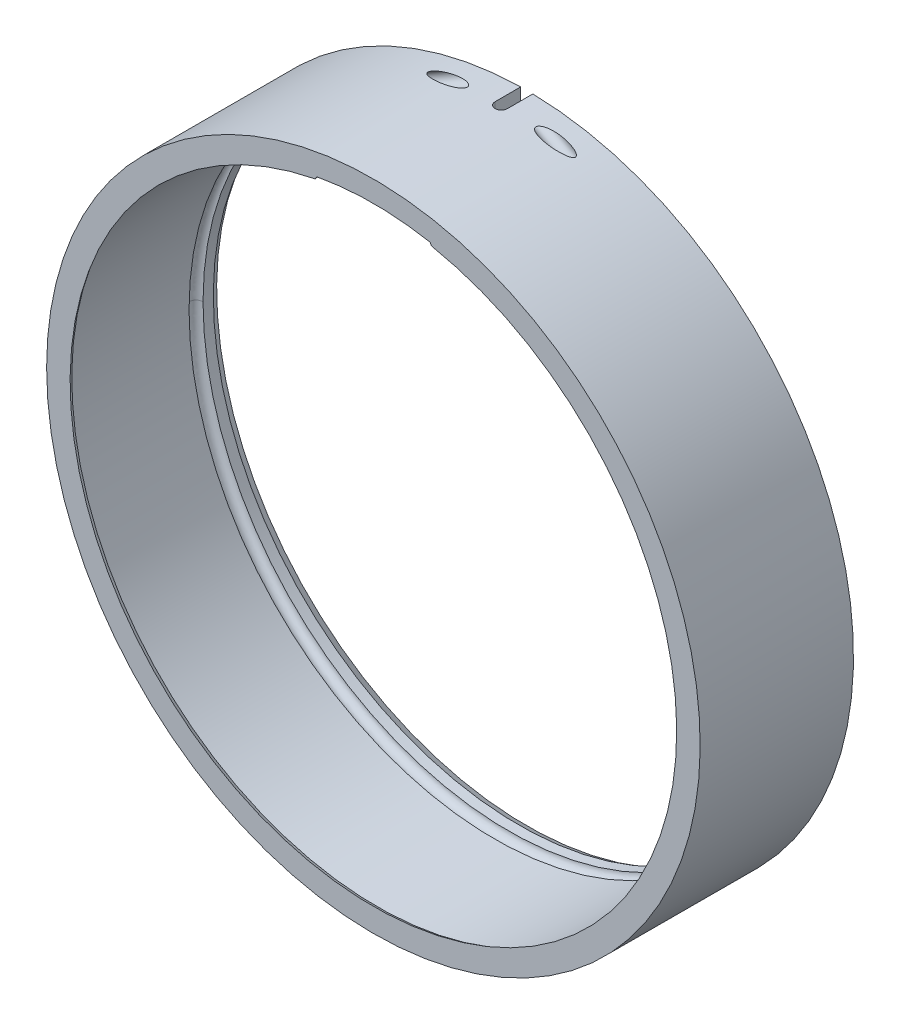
ISO-10303-21;
HEADER;
FILE_DESCRIPTION(('STEP AP214'),'2;1');
FILE_NAME('part.step','',(''),(''),'','','');
FILE_SCHEMA(('AUTOMOTIVE_DESIGN { 1 0 10303 214 1 1 1 1 }'));
ENDSEC;
DATA;
#1=APPLICATION_CONTEXT('core data for automotive mechanical design processes');
#2=APPLICATION_PROTOCOL_DEFINITION('international standard','automotive_design',2000,#1);
#3=PRODUCT_CONTEXT('',#1,'mechanical');
#4=PRODUCT('Part','Part','',(#3));
#5=PRODUCT_RELATED_PRODUCT_CATEGORY('part','',(#4));
#6=PRODUCT_DEFINITION_FORMATION('','',#4);
#7=PRODUCT_DEFINITION_CONTEXT('part definition',#1,'design');
#8=PRODUCT_DEFINITION('design','',#6,#7);
#9=PRODUCT_DEFINITION_SHAPE('','',#8);
#10=(LENGTH_UNIT() NAMED_UNIT(*) SI_UNIT(.MILLI.,.METRE.));
#11=(NAMED_UNIT(*) PLANE_ANGLE_UNIT() SI_UNIT($,.RADIAN.));
#12=(NAMED_UNIT(*) SI_UNIT($,.STERADIAN.) SOLID_ANGLE_UNIT());
#13=UNCERTAINTY_MEASURE_WITH_UNIT(LENGTH_MEASURE(1.E-05),#10,'distance_accuracy_value','');
#14=(GEOMETRIC_REPRESENTATION_CONTEXT(3) GLOBAL_UNCERTAINTY_ASSIGNED_CONTEXT((#13)) GLOBAL_UNIT_ASSIGNED_CONTEXT((#10,
#11,#12)) REPRESENTATION_CONTEXT('',''));
#15=CARTESIAN_POINT('',(0.,0.,0.));
#16=DIRECTION('',(0.,0.,1.));
#17=DIRECTION('',(1.,0.,0.));
#18=AXIS2_PLACEMENT_3D('',#15,#16,#17);
#19=CARTESIAN_POINT('',(-77.609796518,0.,-404.528892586));
#20=CARTESIAN_POINT('',(-77.609796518,-155.219593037,-404.528892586));
#21=CARTESIAN_POINT('',(77.609796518,-155.219593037,-404.528892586));
#22=CARTESIAN_POINT('',(77.609796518,0.,-404.528892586));
#23=CARTESIAN_POINT('',(-78.73150513,0.,-404.41634632));
#24=CARTESIAN_POINT('',(-78.73150513,-157.463010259,-404.41634632));
#25=CARTESIAN_POINT('',(78.73150513,-157.463010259,-404.41634632));
#26=CARTESIAN_POINT('',(78.73150513,0.,-404.41634632));
#27=CARTESIAN_POINT('',(-79.5675,0.,-405.172659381));
#28=CARTESIAN_POINT('',(-79.5675,-159.135,-405.172659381));
#29=CARTESIAN_POINT('',(79.5675,-159.135,-405.172659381));
#30=CARTESIAN_POINT('',(79.5675,0.,-405.172659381));
#31=CARTESIAN_POINT('',(-79.5675,0.,-406.3));
#32=CARTESIAN_POINT('',(-79.5675,-159.135,-406.3));
#33=CARTESIAN_POINT('',(79.5675,-159.135,-406.3));
#34=CARTESIAN_POINT('',(79.5675,0.,-406.3));
#35=CARTESIAN_POINT('',(-79.5675,0.,-407.427340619));
#36=CARTESIAN_POINT('',(-79.5675,-159.135,-407.427340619));
#37=CARTESIAN_POINT('',(79.5675,-159.135,-407.427340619));
#38=CARTESIAN_POINT('',(79.5675,0.,-407.427340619));
#39=CARTESIAN_POINT('',(-78.73150513,0.,-408.18365368));
#40=CARTESIAN_POINT('',(-78.73150513,-157.463010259,-408.18365368));
#41=CARTESIAN_POINT('',(78.73150513,-157.463010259,-408.18365368));
#42=CARTESIAN_POINT('',(78.73150513,0.,-408.18365368));
#43=CARTESIAN_POINT('',(-77.609796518,0.,-408.071107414));
#44=CARTESIAN_POINT('',(-77.609796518,-155.219593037,-408.071107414));
#45=CARTESIAN_POINT('',(77.609796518,-155.219593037,-408.071107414));
#46=CARTESIAN_POINT('',(77.609796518,0.,-408.071107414));
#47=(BOUNDED_SURFACE() B_SPLINE_SURFACE(3,3,((#19,#20,#21,#22),(#23,#24,#25,#26),(#27,#28,#29,
#30),(#31,#32,#33,#34),(#35,#36,#37,#38),(#39,#40,#41,#42),(#43,#44,#45,#46)),.UNSPECIFIED.,.F.,
.F.,.F.) B_SPLINE_SURFACE_WITH_KNOTS((4,3,4),(4,4),(0.,0.5,1.),(0.,1.),
.UNSPECIFIED.) GEOMETRIC_REPRESENTATION_ITEM() RATIONAL_B_SPLINE_SURFACE(((1.,0.333333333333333,
0.333333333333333,1.),(0.78058831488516,0.26019610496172,0.26019610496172,0.78058831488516),
(0.78058831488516,0.26019610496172,0.26019610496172,0.78058831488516),(1.,0.333333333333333,
0.333333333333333,1.),(0.78058831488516,0.26019610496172,0.26019610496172,0.78058831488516),
(0.78058831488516,0.26019610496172,0.26019610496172,0.78058831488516),(1.,0.333333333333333,
0.333333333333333,1.))) REPRESENTATION_ITEM('') SURFACE());
#48=CARTESIAN_POINT('',(-77.609796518,0.,-404.528892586));
#49=CARTESIAN_POINT('',(-78.73150513,0.,-404.41634632));
#50=CARTESIAN_POINT('',(-79.5675,0.,-405.172659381));
#51=CARTESIAN_POINT('',(-79.5675,0.,-406.3));
#52=CARTESIAN_POINT('',(-79.5675,0.,-407.427340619));
#53=CARTESIAN_POINT('',(-78.73150513,0.,-408.18365368));
#54=CARTESIAN_POINT('',(-77.609796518,0.,-408.071107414));
#55=(BOUNDED_CURVE() B_SPLINE_CURVE(3,(#48,#49,#50,#51,#52,#53,#54),.UNSPECIFIED.,.F.,
.F.) B_SPLINE_CURVE_WITH_KNOTS((4,3,4),(0.,0.5,1.),
.UNSPECIFIED.) CURVE() GEOMETRIC_REPRESENTATION_ITEM() RATIONAL_B_SPLINE_CURVE((1.,
0.78058831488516,0.78058831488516,1.,0.78058831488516,0.78058831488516,1.)) REPRESENTATION_ITEM(''));
#56=CARTESIAN_POINT('',(-77.787500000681,-1.59544829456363E-08,-408.079999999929));
#57=VERTEX_POINT('',#56);
#58=CARTESIAN_POINT('',(-77.787500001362,-7.97724147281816E-09,-404.520000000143));
#59=VERTEX_POINT('',#58);
#60=EDGE_CURVE('E301',#57,#59,#55,.F.);
#61=CARTESIAN_POINT('',(0.,0.,-404.520000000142));
#62=DIRECTION('',(0.,0.,-1.));
#63=DIRECTION('',(0.,1.,0.));
#64=AXIS2_PLACEMENT_3D('',#61,#62,#63);
#65=CIRCLE('',#64,77.787500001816);
#66=CARTESIAN_POINT('',(77.787500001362,0.,-404.520000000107));
#67=VERTEX_POINT('',#66);
#68=EDGE_CURVE('E313',#67,#59,#65,.T.);
#69=CARTESIAN_POINT('',(77.609796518,0.,-404.528892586));
#70=CARTESIAN_POINT('',(78.73150513,0.,-404.41634632));
#71=CARTESIAN_POINT('',(79.5675,0.,-405.172659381));
#72=CARTESIAN_POINT('',(79.5675,0.,-406.3));
#73=CARTESIAN_POINT('',(79.5675,0.,-407.427340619));
#74=CARTESIAN_POINT('',(78.73150513,0.,-408.18365368));
#75=CARTESIAN_POINT('',(77.609796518,0.,-408.071107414));
#76=(BOUNDED_CURVE() B_SPLINE_CURVE(3,(#69,#70,#71,#72,#73,#74,#75),.UNSPECIFIED.,.F.,
.F.) B_SPLINE_CURVE_WITH_KNOTS((4,3,4),(0.,0.5,1.),
.UNSPECIFIED.) CURVE() GEOMETRIC_REPRESENTATION_ITEM() RATIONAL_B_SPLINE_CURVE((1.,
0.78058831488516,0.78058831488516,1.,0.78058831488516,0.78058831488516,1.)) REPRESENTATION_ITEM(''));
#77=CARTESIAN_POINT('',(77.7875,-3.49241093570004E-09,-408.079999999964));
#78=VERTEX_POINT('',#77);
#79=EDGE_CURVE('E276',#67,#78,#76,.T.);
#80=CARTESIAN_POINT('',(0.,0.,-408.08));
#81=DIRECTION('',(0.,0.,1.));
#82=DIRECTION('',(1.,0.,0.));
#83=AXIS2_PLACEMENT_3D('',#80,#81,#82);
#84=CIRCLE('',#83,77.7875);
#85=EDGE_CURVE('E290',#57,#78,#84,.T.);
#86=ORIENTED_EDGE('',*,*,#60,.T.);
#87=ORIENTED_EDGE('',*,*,#68,.F.);
#88=ORIENTED_EDGE('',*,*,#79,.T.);
#89=ORIENTED_EDGE('',*,*,#85,.F.);
#90=EDGE_LOOP('',(#86,#87,#88,#89));
#91=FACE_BOUND('',#90,.T.);
#92=ADVANCED_FACE('F36',(#91),#47,.F.);
#93=CARTESIAN_POINT('',(38.88903125,67.357777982,-404.49864));
#94=DIRECTION('',(-0.866025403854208,0.499999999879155,0.));
#95=DIRECTION('',(0.499999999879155,0.866025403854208,0.));
#96=AXIS2_PLACEMENT_3D('',#93,#94,#95);
#97=PLANE('',#96);
#98=CARTESIAN_POINT('',(38.8943749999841,67.3670336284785,-408.079999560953));
#99=CARTESIAN_POINT('',(38.9194142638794,67.4104029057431,-408.079964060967));
#100=CARTESIAN_POINT('',(38.9444407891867,67.4537501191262,-408.077814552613));
#101=CARTESIAN_POINT('',(38.9943132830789,67.5401318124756,-408.069309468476));
#102=CARTESIAN_POINT('',(39.0191592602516,67.5831663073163,-408.062954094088));
#103=CARTESIAN_POINT('',(39.0931185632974,67.7112675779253,-408.037638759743));
#104=CARTESIAN_POINT('',(39.1417342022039,67.7954723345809,-408.012429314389));
#105=CARTESIAN_POINT('',(39.2361570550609,67.9590175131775,-407.946045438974));
#106=CARTESIAN_POINT('',(39.2819629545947,68.038355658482,-407.904863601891));
#107=CARTESIAN_POINT('',(39.3694654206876,68.1899143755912,-407.807709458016));
#108=CARTESIAN_POINT('',(39.4111627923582,68.2621363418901,-407.751740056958));
#109=CARTESIAN_POINT('',(39.4892670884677,68.3974169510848,-407.626595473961));
#110=CARTESIAN_POINT('',(39.5256738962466,68.4604753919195,-407.557420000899));
#111=CARTESIAN_POINT('',(39.5921700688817,68.5756501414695,-407.407815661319));
#112=CARTESIAN_POINT('',(39.6222584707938,68.6277647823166,-407.327385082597));
#113=CARTESIAN_POINT('',(39.6752547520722,68.7195570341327,-407.157565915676));
#114=CARTESIAN_POINT('',(39.6981629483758,68.759235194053,-407.0681777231));
#115=CARTESIAN_POINT('',(39.7361492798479,68.825029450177,-406.88298397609));
#116=CARTESIAN_POINT('',(39.7512279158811,68.8511464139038,-406.787178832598));
#117=CARTESIAN_POINT('',(39.7731294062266,68.8890809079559,-406.591863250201));
#118=CARTESIAN_POINT('',(39.7799520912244,68.9008981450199,-406.492352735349));
#119=CARTESIAN_POINT('',(39.7851479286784,68.909897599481,-406.292451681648));
#120=CARTESIAN_POINT('',(39.7835208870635,68.9070794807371,-406.19206112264));
#121=CARTESIAN_POINT('',(39.7718615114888,68.8868848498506,-405.993249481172));
#122=CARTESIAN_POINT('',(39.7618292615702,68.8695084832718,-405.894828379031));
#123=CARTESIAN_POINT('',(39.7336502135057,68.8207009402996,-405.702762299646));
#124=CARTESIAN_POINT('',(39.7155034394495,68.7892698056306,-405.609117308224));
#125=CARTESIAN_POINT('',(39.6715882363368,68.71320644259,-405.429208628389));
#126=CARTESIAN_POINT('',(39.6458196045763,68.668573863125,-405.342945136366));
#127=CARTESIAN_POINT('',(39.6020546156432,68.5927706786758,-405.221051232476));
#128=CARTESIAN_POINT('',(39.5866110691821,68.5660216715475,-405.181663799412));
#129=CARTESIAN_POINT('',(39.5541068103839,68.5097226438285,-405.105587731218));
#130=CARTESIAN_POINT('',(39.5370445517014,68.480169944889,-405.068901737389));
#131=CARTESIAN_POINT('',(39.483648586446,68.3876854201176,-404.963410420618));
#132=CARTESIAN_POINT('',(39.4450664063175,68.3208591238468,-404.899062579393));
#133=CARTESIAN_POINT('',(39.3630426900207,68.1787898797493,-404.784256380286));
#134=CARTESIAN_POINT('',(39.3196013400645,68.1035472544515,-404.73379749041));
#135=CARTESIAN_POINT('',(39.2517460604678,67.9860184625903,-404.669578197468));
#136=CARTESIAN_POINT('',(39.2286532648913,67.9460205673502,-404.650068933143));
#137=CARTESIAN_POINT('',(39.1817406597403,67.864765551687,-404.615022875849));
#138=CARTESIAN_POINT('',(39.157921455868,67.8235094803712,-404.59948286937));
#139=CARTESIAN_POINT('',(39.1097391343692,67.7400552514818,-404.572488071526));
#140=CARTESIAN_POINT('',(39.0853765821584,67.6978580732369,-404.56102922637));
#141=CARTESIAN_POINT('',(39.0362600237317,67.6127856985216,-404.542256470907));
#142=CARTESIAN_POINT('',(39.0115061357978,67.5699107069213,-404.534941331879));
#143=CARTESIAN_POINT('',(38.971310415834,67.5002896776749,-404.526503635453));
#144=CARTESIAN_POINT('',(38.9559338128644,67.4736566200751,-404.524082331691));
#145=CARTESIAN_POINT('',(38.9251637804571,67.4203613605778,-404.520842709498));
#146=CARTESIAN_POINT('',(38.9097704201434,67.3936992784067,-404.520021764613));
#147=CARTESIAN_POINT('',(38.8943750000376,67.3670336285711,-404.520000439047));
#148=B_SPLINE_CURVE_WITH_KNOTS('',3,(#98,#99,#100,#101,#102,#103,#104,#105,#106,#107,#108,#109,
#110,#111,#112,#113,#114,#115,#116,#117,#118,#119,#120,#121,#122,#123,#124,#125,#126,#127,#128,
#129,#130,#131,#132,#133,#134,#135,#136,#137,#138,#139,#140,#141,#142,#143,#144,#145,#146,#147),
.UNSPECIFIED.,.F.,.F.,(4,2,2,2,2,2,2,2,2,2,2,2,2,2,2,2,2,2,2,2,2,2,2,2,4),(0.,0.150143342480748,
0.300279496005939,0.600072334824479,0.900004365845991,1.19987750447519,1.49975725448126,
1.79968267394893,2.09959485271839,2.39948784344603,2.69938698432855,2.99929301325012,
3.29919604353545,3.59909818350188,3.89900830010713,4.0490168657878,4.19917020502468,
4.49907853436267,4.79897537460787,4.9492375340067,5.09937765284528,5.24936821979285,
5.39931428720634,5.49182132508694,5.58417641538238),.UNSPECIFIED.);
#149=CARTESIAN_POINT('',(38.8943749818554,67.3670336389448,-408.079999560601));
#150=VERTEX_POINT('',#149);
#151=CARTESIAN_POINT('',(38.8943749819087,67.3670336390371,-404.520000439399));
#152=VERTEX_POINT('',#151);
#153=EDGE_CURVE('E154',#150,#152,#148,.T.);
#154=ORIENTED_EDGE('',*,*,#153,.T.);
#155=CARTESIAN_POINT('',(38.8949999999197,67.3681161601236,-406.3));
#156=DIRECTION('',(0.866025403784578,-0.499999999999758,0.));
#157=DIRECTION('',(0.499999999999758,0.866025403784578,0.));
#158=AXIS2_PLACEMENT_3D('',#155,#156,#157);
#159=CIRCLE('',#158,1.78000000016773);
#160=EDGE_CURVE('E179',#150,#152,#159,.T.);
#161=ORIENTED_EDGE('',*,*,#160,.F.);
#162=EDGE_LOOP('',(#154,#161));
#163=FACE_BOUND('',#162,.T.);
#164=ADVANCED_FACE('F201',(#163),#97,.T.);
#165=CARTESIAN_POINT('',(-38.88903125,67.357777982,-408.10136));
#166=DIRECTION('',(0.866025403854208,0.499999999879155,0.));
#167=DIRECTION('',(-0.499999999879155,0.866025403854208,0.));
#168=AXIS2_PLACEMENT_3D('',#165,#166,#167);
#169=PLANE('',#168);
#170=CARTESIAN_POINT('',(-38.8949999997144,67.3681161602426,-406.3));
#171=DIRECTION('',(-0.866025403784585,-0.499999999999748,0.));
#172=DIRECTION('',(0.499999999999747,-0.866025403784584,0.));
#173=AXIS2_PLACEMENT_3D('',#170,#171,#172);
#174=CIRCLE('',#173,1.77999999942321);
#175=CARTESIAN_POINT('',(-38.894374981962,67.3670336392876,-404.520000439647));
#176=VERTEX_POINT('',#175);
#177=CARTESIAN_POINT('',(-39.7843749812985,68.9085588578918,-406.300000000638));
#178=VERTEX_POINT('',#177);
#179=EDGE_CURVE('E159',#176,#178,#174,.T.);
#180=ORIENTED_EDGE('',*,*,#179,.F.);
#181=CARTESIAN_POINT('',(-38.8943750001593,67.3670336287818,-404.520000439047));
#182=CARTESIAN_POINT('',(-38.9194149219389,67.4104040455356,-404.52003594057));
#183=CARTESIAN_POINT('',(-38.9444421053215,67.4537523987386,-404.522185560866));
#184=CARTESIAN_POINT('',(-38.9943158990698,67.5401363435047,-404.530691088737));
#185=CARTESIAN_POINT('',(-39.0191625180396,67.5831719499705,-404.537046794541));
#186=CARTESIAN_POINT('',(-39.0931211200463,67.7112720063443,-404.562362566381));
#187=CARTESIAN_POINT('',(-39.1417354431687,67.7954744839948,-404.58757157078));
#188=CARTESIAN_POINT('',(-39.23615658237,67.9590166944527,-404.653954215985));
#189=CARTESIAN_POINT('',(-39.2819620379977,68.0383540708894,-404.695135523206));
#190=CARTESIAN_POINT('',(-39.3694645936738,68.1899129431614,-404.792289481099));
#191=CARTESIAN_POINT('',(-39.4111624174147,68.2621356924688,-404.848259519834));
#192=CARTESIAN_POINT('',(-39.4892662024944,68.397415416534,-404.973402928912));
#193=CARTESIAN_POINT('',(-39.5256722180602,68.4604724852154,-405.042576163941));
#194=CARTESIAN_POINT('',(-39.5921687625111,68.5756478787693,-405.19218145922));
#195=CARTESIAN_POINT('',(-39.6222580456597,68.6277640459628,-405.272615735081));
#196=CARTESIAN_POINT('',(-39.6752615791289,68.7195688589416,-405.442453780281));
#197=CARTESIAN_POINT('',(-39.698174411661,68.7592550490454,-405.531859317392));
#198=CARTESIAN_POINT('',(-39.7361579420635,68.8250444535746,-405.717077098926));
#199=CARTESIAN_POINT('',(-39.7512332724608,68.851155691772,-405.812885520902));
#200=CARTESIAN_POINT('',(-39.7693481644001,68.8825316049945,-405.97440510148));
#201=CARTESIAN_POINT('',(-39.7747456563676,68.8918803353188,-406.039097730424));
#202=CARTESIAN_POINT('',(-39.7819460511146,68.9043517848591,-406.169184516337));
#203=CARTESIAN_POINT('',(-39.783754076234,68.9074833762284,-406.234577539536));
#204=CARTESIAN_POINT('',(-39.7837499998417,68.9074763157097,-406.300000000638));
#205=B_SPLINE_CURVE_WITH_KNOTS('',3,(#181,#182,#183,#184,#185,#186,#187,#188,#189,#190,#191,
#192,#193,#194,#195,#196,#197,#198,#199,#200,#201,#202,#203,#204),.UNSPECIFIED.,.F.,.F.,(4,2,2,
2,2,2,2,2,2,2,2,4),(0.,0.150147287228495,0.30028737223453,0.600072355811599,0.900001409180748,
1.19987752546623,1.49975056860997,1.79968269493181,2.09967403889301,2.39948786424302,
2.59587850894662,2.79198869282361),.UNSPECIFIED.);
#206=EDGE_CURVE('E146',#176,#178,#205,.T.);
#207=ORIENTED_EDGE('',*,*,#206,.T.);
#208=EDGE_LOOP('',(#180,#207));
#209=FACE_BOUND('',#208,.T.);
#210=ADVANCED_FACE('F164',(#209),#169,.T.);
#211=CARTESIAN_POINT('',(11.825,74.6125,-374.70249955));
#212=DIRECTION('',(0.,0.,1.));
#213=DIRECTION('',(0.,-1.,0.));
#214=AXIS2_PLACEMENT_3D('',#211,#212,#213);
#215=CYLINDRICAL_SURFACE('',#214,3.175);
#216=CARTESIAN_POINT('',(11.825,74.6125,-373.666499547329));
#217=DIRECTION('',(0.,0.,-1.));
#218=DIRECTION('',(-1.,0.,0.));
#219=AXIS2_PLACEMENT_3D('',#216,#217,#218);
#220=CIRCLE('',#219,3.175);
#221=CARTESIAN_POINT('',(14.4221294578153,76.4388470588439,-373.66649955));
#222=VERTEX_POINT('',#221);
#223=CARTESIAN_POINT('',(14.776355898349,75.783022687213,-373.666499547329));
#224=VERTEX_POINT('',#223);
#225=EDGE_CURVE('E134',#222,#224,#220,.T.);
#226=ORIENTED_EDGE('',*,*,#225,.F.);
#227=DIRECTION('',(0.,0.,-1.));
#228=VECTOR('',#227,1.);
#229=CARTESIAN_POINT('',(14.4221294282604,76.4388470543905,-389.093249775));
#230=LINE('',#229,#228);
#231=CARTESIAN_POINT('',(14.4221294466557,76.4388470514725,-374.666499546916));
#232=VERTEX_POINT('',#231);
#233=EDGE_CURVE('E328',#232,#222,#230,.F.);
#234=ORIENTED_EDGE('',*,*,#233,.F.);
#235=CARTESIAN_POINT('',(14.4221294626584,76.4388470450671,-374.666499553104));
#236=CARTESIAN_POINT('',(14.460332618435,76.3844989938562,-374.586267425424));
#237=CARTESIAN_POINT('',(14.4961407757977,76.3299763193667,-374.505042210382));
#238=CARTESIAN_POINT('',(14.5632618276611,76.2208113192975,-374.341056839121));
#239=CARTESIAN_POINT('',(14.594582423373,76.1661693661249,-374.258299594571));
#240=CARTESIAN_POINT('',(14.6531511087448,76.0568098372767,-374.091426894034));
#241=CARTESIAN_POINT('',(14.6803995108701,76.0020922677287,-374.007311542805));
#242=CARTESIAN_POINT('',(14.7311441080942,75.892573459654,-373.837787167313));
#243=CARTESIAN_POINT('',(14.7546336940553,75.8377722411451,-373.752376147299));
#244=CARTESIAN_POINT('',(14.7763558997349,75.7830226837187,-373.666499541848));
#245=B_SPLINE_CURVE_WITH_KNOTS('',3,(#235,#236,#237,#238,#239,#240,#241,#242,#243,#244),
.UNSPECIFIED.,.F.,.F.,(4,2,2,2,4),(0.,0.312430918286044,0.624319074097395,0.936183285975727,
1.2485899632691),.UNSPECIFIED.);
#246=EDGE_CURVE('E330',#232,#224,#245,.T.);
#247=ORIENTED_EDGE('',*,*,#246,.T.);
#248=EDGE_LOOP('',(#226,#234,#247));
#249=FACE_BOUND('',#248,.T.);
#250=ADVANCED_FACE('F200',(#249),#215,.F.);
#251=CARTESIAN_POINT('',(-11.825,74.6125,-368.66649955));
#252=DIRECTION('',(0.,0.,-1.));
#253=DIRECTION('',(-1.,0.,0.));
#254=AXIS2_PLACEMENT_3D('',#251,#252,#253);
#255=CYLINDRICAL_SURFACE('',#254,3.175);
#256=CARTESIAN_POINT('',(-11.825,74.6125,-373.666499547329));
#257=DIRECTION('',(0.,0.,-1.));
#258=DIRECTION('',(-1.,0.,0.));
#259=AXIS2_PLACEMENT_3D('',#256,#257,#258);
#260=CIRCLE('',#259,3.175);
#261=CARTESIAN_POINT('',(-14.7763558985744,75.7830226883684,-373.66649955));
#262=VERTEX_POINT('',#261);
#263=CARTESIAN_POINT('',(-14.4221294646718,76.4388470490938,-373.66649955));
#264=VERTEX_POINT('',#263);
#265=EDGE_CURVE('E339',#262,#264,#260,.T.);
#266=ORIENTED_EDGE('',*,*,#265,.F.);
#267=CARTESIAN_POINT('',(-14.7763559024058,75.7830226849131,-373.666499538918));
#268=CARTESIAN_POINT('',(-14.7546336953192,75.8377722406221,-373.75237614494));
#269=CARTESIAN_POINT('',(-14.7311441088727,75.8925734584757,-373.83778716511));
#270=CARTESIAN_POINT('',(-14.680399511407,76.0020922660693,-374.007311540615));
#271=CARTESIAN_POINT('',(-14.6531511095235,76.05680983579,-374.091426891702));
#272=CARTESIAN_POINT('',(-14.5945824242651,76.166169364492,-374.258299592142));
#273=CARTESIAN_POINT('',(-14.5632618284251,76.2208113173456,-374.341056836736));
#274=CARTESIAN_POINT('',(-14.4961407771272,76.3299763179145,-374.505042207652));
#275=CARTESIAN_POINT('',(-14.4603326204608,76.3844989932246,-374.586267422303));
#276=CARTESIAN_POINT('',(-14.4221294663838,76.4388470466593,-374.666499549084));
#277=B_SPLINE_CURVE_WITH_KNOTS('',3,(#267,#268,#269,#270,#271,#272,#273,#274,#275,#276),
.UNSPECIFIED.,.F.,.F.,(4,2,2,2,4),(0.,0.312406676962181,0.624270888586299,0.936159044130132,
1.24858996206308),.UNSPECIFIED.);
#278=CARTESIAN_POINT('',(-14.4221294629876,76.4388470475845,-374.666499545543));
#279=VERTEX_POINT('',#278);
#280=EDGE_CURVE('E336',#262,#279,#277,.T.);
#281=ORIENTED_EDGE('',*,*,#280,.T.);
#282=DIRECTION('',(0.,0.,1.));
#283=VECTOR('',#282,1.);
#284=CARTESIAN_POINT('',(-14.4221294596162,76.4388470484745,-389.093249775));
#285=LINE('',#284,#283);
#286=EDGE_CURVE('E325',#264,#279,#285,.F.);
#287=ORIENTED_EDGE('',*,*,#286,.F.);
#288=EDGE_LOOP('',(#266,#281,#287));
#289=FACE_BOUND('',#288,.T.);
#290=ADVANCED_FACE('F356',(#289),#255,.F.);
#291=CARTESIAN_POINT('',(0.,0.,-373.66649955));
#292=DIRECTION('',(0.,0.,-1.));
#293=DIRECTION('',(-1.,0.,0.));
#294=AXIS2_PLACEMENT_3D('',#291,#292,#293);
#295=CONICAL_SURFACE('',#294,77.210149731,0.523598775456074);
#296=CARTESIAN_POINT('',(0.,0.,-374.666499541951));
#297=DIRECTION('',(0.,0.,1.));
#298=DIRECTION('',(1.,0.,0.));
#299=AXIS2_PLACEMENT_3D('',#296,#297,#298);
#300=CIRCLE('',#299,77.7875);
#301=EDGE_CURVE('E124',#279,#232,#300,.T.);
#302=ORIENTED_EDGE('',*,*,#301,.F.);
#303=ORIENTED_EDGE('',*,*,#280,.F.);
#304=CARTESIAN_POINT('',(0.,0.,-373.66649955));
#305=DIRECTION('',(0.,0.,-1.));
#306=DIRECTION('',(-1.,0.,0.));
#307=AXIS2_PLACEMENT_3D('',#304,#305,#306);
#308=CIRCLE('',#307,77.210149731);
#309=EDGE_CURVE('E295',#224,#262,#308,.T.);
#310=ORIENTED_EDGE('',*,*,#309,.F.);
#311=ORIENTED_EDGE('',*,*,#246,.F.);
#312=EDGE_LOOP('',(#302,#303,#310,#311));
#313=FACE_BOUND('',#312,.T.);
#314=ADVANCED_FACE('F352',(#313),#295,.F.);
#315=CARTESIAN_POINT('',(0.,0.,-404.52));
#316=DIRECTION('',(0.,0.,1.));
#317=DIRECTION('',(1.,0.,0.));
#318=AXIS2_PLACEMENT_3D('',#315,#316,#317);
#319=CYLINDRICAL_SURFACE('',#318,77.7875);
#320=ORIENTED_EDGE('',*,*,#68,.T.);
#321=CARTESIAN_POINT('',(0.,0.,-404.520000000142));
#322=DIRECTION('',(0.,0.,-1.));
#323=DIRECTION('',(0.,1.,0.));
#324=AXIS2_PLACEMENT_3D('',#321,#322,#323);
#325=CIRCLE('',#324,77.787500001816);
#326=EDGE_CURVE('E285',#59,#67,#325,.T.);
#327=ORIENTED_EDGE('',*,*,#326,.T.);
#328=EDGE_LOOP('',(#320,#327));
#329=FACE_BOUND('',#328,.T.);
#330=ORIENTED_EDGE('',*,*,#286,.T.);
#331=ORIENTED_EDGE('',*,*,#301,.T.);
#332=ORIENTED_EDGE('',*,*,#233,.T.);
#333=CARTESIAN_POINT('',(0.,0.,-373.66649955));
#334=DIRECTION('',(0.,0.,1.));
#335=DIRECTION('',(1.,0.,0.));
#336=AXIS2_PLACEMENT_3D('',#333,#334,#335);
#337=CIRCLE('',#336,77.7875);
#338=EDGE_CURVE('E327',#222,#264,#337,.T.);
#339=ORIENTED_EDGE('',*,*,#338,.T.);
#340=EDGE_LOOP('',(#330,#331,#332,#339));
#341=FACE_BOUND('',#340,.T.);
#342=ADVANCED_FACE('F355',(#329,#341),#319,.F.);
#343=CARTESIAN_POINT('',(77.609796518,0.,-404.528892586));
#344=CARTESIAN_POINT('',(77.609796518,155.219593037,-404.528892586));
#345=CARTESIAN_POINT('',(-77.609796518,155.219593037,-404.528892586));
#346=CARTESIAN_POINT('',(-77.609796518,0.,-404.528892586));
#347=CARTESIAN_POINT('',(78.73150513,0.,-404.41634632));
#348=CARTESIAN_POINT('',(78.73150513,157.463010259,-404.41634632));
#349=CARTESIAN_POINT('',(-78.73150513,157.463010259,-404.41634632));
#350=CARTESIAN_POINT('',(-78.73150513,0.,-404.41634632));
#351=CARTESIAN_POINT('',(79.5675,0.,-405.172659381));
#352=CARTESIAN_POINT('',(79.5675,159.135,-405.172659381));
#353=CARTESIAN_POINT('',(-79.5675,159.135,-405.172659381));
#354=CARTESIAN_POINT('',(-79.5675,0.,-405.172659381));
#355=CARTESIAN_POINT('',(79.5675,0.,-406.3));
#356=CARTESIAN_POINT('',(79.5675,159.135,-406.3));
#357=CARTESIAN_POINT('',(-79.5675,159.135,-406.3));
#358=CARTESIAN_POINT('',(-79.5675,0.,-406.3));
#359=CARTESIAN_POINT('',(79.5675,0.,-407.427340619));
#360=CARTESIAN_POINT('',(79.5675,159.135,-407.427340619));
#361=CARTESIAN_POINT('',(-79.5675,159.135,-407.427340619));
#362=CARTESIAN_POINT('',(-79.5675,0.,-407.427340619));
#363=CARTESIAN_POINT('',(78.73150513,0.,-408.18365368));
#364=CARTESIAN_POINT('',(78.73150513,157.463010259,-408.18365368));
#365=CARTESIAN_POINT('',(-78.73150513,157.463010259,-408.18365368));
#366=CARTESIAN_POINT('',(-78.73150513,0.,-408.18365368));
#367=CARTESIAN_POINT('',(77.609796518,0.,-408.071107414));
#368=CARTESIAN_POINT('',(77.609796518,155.219593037,-408.071107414));
#369=CARTESIAN_POINT('',(-77.609796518,155.219593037,-408.071107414));
#370=CARTESIAN_POINT('',(-77.609796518,0.,-408.071107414));
#371=(BOUNDED_SURFACE() B_SPLINE_SURFACE(3,3,((#343,#344,#345,#346),(#347,#348,#349,#350),(#351,
#352,#353,#354),(#355,#356,#357,#358),(#359,#360,#361,#362),(#363,#364,#365,#366),(#367,#368,
#369,#370)),.UNSPECIFIED.,.F.,.F.,.F.) B_SPLINE_SURFACE_WITH_KNOTS((4,3,4),(4,4),(0.,0.5,1.),
(0.,1.),.UNSPECIFIED.) GEOMETRIC_REPRESENTATION_ITEM() RATIONAL_B_SPLINE_SURFACE(((1.,
0.333333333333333,0.333333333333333,1.),(0.78058831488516,0.26019610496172,0.26019610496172,
0.78058831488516),(0.78058831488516,0.26019610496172,0.26019610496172,0.78058831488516),(1.,
0.333333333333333,0.333333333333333,1.),(0.78058831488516,0.26019610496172,0.26019610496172,
0.78058831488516),(0.78058831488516,0.26019610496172,0.26019610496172,0.78058831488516),(1.,
0.333333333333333,0.333333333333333,1.))) REPRESENTATION_ITEM('') SURFACE());
#372=CARTESIAN_POINT('',(-17.6309917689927,77.5895301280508,-406.3));
#373=CARTESIAN_POINT('',(-17.6309916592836,77.589530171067,-406.303304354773));
#374=CARTESIAN_POINT('',(-17.6310494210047,77.5895075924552,-406.30660867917));
#375=CARTESIAN_POINT('',(-17.631279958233,77.5894174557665,-406.313218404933));
#376=CARTESIAN_POINT('',(-17.6314529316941,77.5893498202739,-406.316523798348));
#377=CARTESIAN_POINT('',(-17.6319138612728,77.5891695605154,-406.323135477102));
#378=CARTESIAN_POINT('',(-17.6322021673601,77.5890567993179,-406.326441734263));
#379=CARTESIAN_POINT('',(-17.6328935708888,77.5887863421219,-406.333054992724));
#380=CARTESIAN_POINT('',(-17.6332971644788,77.5886284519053,-406.336361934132));
#381=CARTESIAN_POINT('',(-17.6342190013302,77.5882677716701,-406.342976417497));
#382=CARTESIAN_POINT('',(-17.6347378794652,77.5880647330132,-406.346283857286));
#383=CARTESIAN_POINT('',(-17.6358901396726,77.5876137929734,-406.352899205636));
#384=CARTESIAN_POINT('',(-17.6365242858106,77.5873655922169,-406.356206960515));
#385=CARTESIAN_POINT('',(-17.6379069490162,77.5868243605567,-406.362822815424));
#386=CARTESIAN_POINT('',(-17.6386563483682,77.5865309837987,-406.366130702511));
#387=CARTESIAN_POINT('',(-17.6402693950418,77.5858994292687,-406.372746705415));
#388=CARTESIAN_POINT('',(-17.6411340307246,77.5855608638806,-406.376054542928));
#389=CARTESIAN_POINT('',(-17.6429774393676,77.5848389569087,-406.382670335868));
#390=CARTESIAN_POINT('',(-17.643957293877,77.584455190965,-406.385977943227));
#391=CARTESIAN_POINT('',(-17.646031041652,77.5836429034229,-406.392593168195));
#392=CARTESIAN_POINT('',(-17.6471260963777,77.5832139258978,-406.395900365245));
#393=CARTESIAN_POINT('',(-17.6494301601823,77.5823112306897,-406.402514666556));
#394=CARTESIAN_POINT('',(-17.650640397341,77.581837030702,-406.405821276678));
#395=CARTESIAN_POINT('',(-17.6531747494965,77.5808439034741,-406.412434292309));
#396=CARTESIAN_POINT('',(-17.6545001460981,77.5803244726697,-406.415740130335));
#397=CARTESIAN_POINT('',(-17.6572647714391,77.5792408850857,-406.422351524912));
#398=CARTESIAN_POINT('',(-17.6587053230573,77.5786762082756,-406.425656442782));
#399=CARTESIAN_POINT('',(-17.6617001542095,77.5775021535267,-406.432265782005));
#400=CARTESIAN_POINT('',(-17.6632557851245,77.5768922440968,-406.435569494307));
#401=CARTESIAN_POINT('',(-17.6681310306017,77.5749806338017,-406.445557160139));
#402=CARTESIAN_POINT('',(-17.6715933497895,77.5736227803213,-406.452161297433));
#403=CARTESIAN_POINT('',(-17.6789669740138,77.5707304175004,-406.465368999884));
#404=CARTESIAN_POINT('',(-17.6828892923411,77.5691915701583,-406.471965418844));
#405=CARTESIAN_POINT('',(-17.6911831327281,77.5659370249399,-406.485157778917));
#406=CARTESIAN_POINT('',(-17.6955654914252,77.5642170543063,-406.491745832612));
#407=CARTESIAN_POINT('',(-17.7047794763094,77.5606001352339,-406.504920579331));
#408=CARTESIAN_POINT('',(-17.7096215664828,77.5586990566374,-406.511498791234));
#409=CARTESIAN_POINT('',(-17.7197553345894,77.5547197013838,-406.524653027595));
#410=CARTESIAN_POINT('',(-17.7250569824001,77.5526374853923,-406.531220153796));
#411=CARTESIAN_POINT('',(-17.7361102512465,77.5482956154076,-406.544351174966));
#412=CARTESIAN_POINT('',(-17.7418712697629,77.5460322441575,-406.550905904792));
#413=CARTESIAN_POINT('',(-17.7538437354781,77.5413278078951,-406.564010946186));
#414=CARTESIAN_POINT('',(-17.7600639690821,77.538883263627,-406.570551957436));
#415=CARTESIAN_POINT('',(-17.7729552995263,77.5338162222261,-406.583628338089));
#416=CARTESIAN_POINT('',(-17.7796345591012,77.5311904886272,-406.590154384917));
#417=CARTESIAN_POINT('',(-17.793444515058,77.5257608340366,-406.603199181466));
#418=CARTESIAN_POINT('',(-17.8005827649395,77.5229539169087,-406.609708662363));
#419=CARTESIAN_POINT('',(-17.8174578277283,77.5163171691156,-406.624616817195));
#420=CARTESIAN_POINT('',(-17.8272668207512,77.5124585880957,-406.632920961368));
#421=CARTESIAN_POINT('',(-17.8476309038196,77.5044455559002,-406.649528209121));
#422=CARTESIAN_POINT('',(-17.8581992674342,77.5002857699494,-406.657812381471));
#423=CARTESIAN_POINT('',(-17.8800835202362,77.4916691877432,-406.674376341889));
#424=CARTESIAN_POINT('',(-17.8914112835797,77.4872075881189,-406.682637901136));
#425=CARTESIAN_POINT('',(-17.9148150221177,77.4779864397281,-406.699152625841));
#426=CARTESIAN_POINT('',(-17.9269015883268,77.4732225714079,-406.707388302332));
#427=CARTESIAN_POINT('',(-17.9651007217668,77.4581608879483,-406.732620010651));
#428=CARTESIAN_POINT('',(-17.9915838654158,77.4477105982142,-406.74896540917));
#429=CARTESIAN_POINT('',(-18.0475099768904,77.4256242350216,-406.781645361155));
#430=CARTESIAN_POINT('',(-18.0770124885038,77.4139631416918,-406.797859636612));
#431=CARTESIAN_POINT('',(-18.1333717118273,77.3916681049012,-406.827307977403));
#432=CARTESIAN_POINT('',(-18.1601695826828,77.381059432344,-406.840674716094));
#433=CARTESIAN_POINT('',(-18.2158640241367,77.3589938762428,-406.867368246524));
#434=CARTESIAN_POINT('',(-18.2447842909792,77.347526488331,-406.880636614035));
#435=CARTESIAN_POINT('',(-18.3373787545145,77.3107789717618,-406.92155746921));
#436=CARTESIAN_POINT('',(-18.4016433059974,77.2852266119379,-406.947632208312));
#437=CARTESIAN_POINT('',(-18.5136126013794,77.2406194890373,-406.990177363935));
#438=CARTESIAN_POINT('',(-18.5611041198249,77.2216729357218,-407.007340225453));
#439=CARTESIAN_POINT('',(-18.6598019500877,77.1822428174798,-407.041500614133));
#440=CARTESIAN_POINT('',(-18.7110355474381,77.1617445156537,-407.058402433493));
#441=CARTESIAN_POINT('',(-18.8381993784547,77.110792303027,-407.098649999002));
#442=CARTESIAN_POINT('',(-18.9143195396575,77.0802270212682,-407.121250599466));
#443=CARTESIAN_POINT('',(-19.1631473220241,76.980087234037,-407.191375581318));
#444=CARTESIAN_POINT('',(-19.3368271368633,76.9098385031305,-407.234463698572));
#445=CARTESIAN_POINT('',(-19.7120390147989,76.7572989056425,-407.319351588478));
#446=CARTESIAN_POINT('',(-19.9137566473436,76.6748138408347,-407.359939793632));
#447=CARTESIAN_POINT('',(-20.2723976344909,76.52729409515,-407.425827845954));
#448=CARTESIAN_POINT('',(-20.4291763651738,76.462513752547,-407.452512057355));
#449=CARTESIAN_POINT('',(-20.7558251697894,76.3269280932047,-407.504579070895));
#450=CARTESIAN_POINT('',(-20.9257160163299,76.2560637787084,-407.52967639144));
#451=CARTESIAN_POINT('',(-21.2784527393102,76.1082200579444,-407.57844753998));
#452=CARTESIAN_POINT('',(-21.4613086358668,76.0311827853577,-407.601870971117));
#453=CARTESIAN_POINT('',(-21.8398253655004,75.8708860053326,-407.647199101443));
#454=CARTESIAN_POINT('',(-22.0354876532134,75.7875680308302,-407.668883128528));
#455=CARTESIAN_POINT('',(-22.4394526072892,75.6145912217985,-407.710664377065));
#456=CARTESIAN_POINT('',(-22.6477496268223,75.5248724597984,-407.730566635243));
#457=CARTESIAN_POINT('',(-23.0262496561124,75.3608577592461,-407.76424447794));
#458=CARTESIAN_POINT('',(-23.1964844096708,75.286727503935,-407.778475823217));
#459=CARTESIAN_POINT('',(-23.5429260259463,75.1351405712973,-407.805793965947));
#460=CARTESIAN_POINT('',(-23.7191272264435,75.0576602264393,-407.818821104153));
#461=CARTESIAN_POINT('',(-24.077430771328,74.8993336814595,-407.843757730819));
#462=CARTESIAN_POINT('',(-24.2595263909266,74.8184637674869,-407.855612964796));
#463=CARTESIAN_POINT('',(-24.6295429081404,74.6533078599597,-407.878239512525));
#464=CARTESIAN_POINT('',(-24.8174560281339,74.5689977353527,-407.888961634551));
#465=CARTESIAN_POINT('',(-25.1990265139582,74.3969018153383,-407.909361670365));
#466=CARTESIAN_POINT('',(-25.3926750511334,74.3090911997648,-407.918995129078));
#467=CARTESIAN_POINT('',(-25.7624444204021,74.1404976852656,-407.936183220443));
#468=CARTESIAN_POINT('',(-25.9385920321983,74.0597845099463,-407.943846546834));
#469=CARTESIAN_POINT('',(-26.2932175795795,73.8964987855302,-407.958322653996));
#470=CARTESIAN_POINT('',(-26.4716915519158,73.8139163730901,-407.965121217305));
#471=CARTESIAN_POINT('',(-26.8309384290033,73.6468768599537,-407.977927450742));
#472=CARTESIAN_POINT('',(-27.0117072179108,73.5624099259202,-407.983922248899));
#473=CARTESIAN_POINT('',(-27.3755101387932,73.3915801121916,-407.995179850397));
#474=CARTESIAN_POINT('',(-27.5585399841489,73.3052073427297,-408.000431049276));
#475=CARTESIAN_POINT('',(-27.9268284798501,73.1305379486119,-408.010259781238));
#476=CARTESIAN_POINT('',(-28.1120826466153,73.0422312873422,-408.014826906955));
#477=CARTESIAN_POINT('',(-28.4761288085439,72.8678099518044,-408.02314552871));
#478=CARTESIAN_POINT('',(-28.6549318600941,72.7817193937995,-408.02691900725));
#479=CARTESIAN_POINT('',(-29.0127701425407,72.6085899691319,-408.033911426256));
#480=CARTESIAN_POINT('',(-29.1918043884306,72.5215489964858,-408.037128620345));
#481=CARTESIAN_POINT('',(-29.550097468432,72.346516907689,-408.04306709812));
#482=CARTESIAN_POINT('',(-29.7293553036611,72.2585236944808,-408.045786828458));
#483=CARTESIAN_POINT('',(-30.0880870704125,72.0815826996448,-408.050785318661));
#484=CARTESIAN_POINT('',(-30.2675599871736,71.9926328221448,-408.05306270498));
#485=CARTESIAN_POINT('',(-30.6267116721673,71.8137701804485,-408.057228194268));
#486=CARTESIAN_POINT('',(-30.8063894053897,71.7238553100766,-408.059115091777));
#487=CARTESIAN_POINT('',(-31.1650460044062,71.5435046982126,-408.062538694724));
#488=CARTESIAN_POINT('',(-31.3440255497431,71.4530703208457,-408.064076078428));
#489=CARTESIAN_POINT('',(-31.7012644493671,71.271702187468,-408.066847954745));
#490=CARTESIAN_POINT('',(-31.8795245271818,71.1807698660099,-408.068083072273));
#491=CARTESIAN_POINT('',(-32.235327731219,70.9984095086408,-408.07029456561));
#492=CARTESIAN_POINT('',(-32.4128715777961,70.9069828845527,-408.071271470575));
#493=CARTESIAN_POINT('',(-32.7672455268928,70.7236373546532,-408.073006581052));
#494=CARTESIAN_POINT('',(-32.9440763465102,70.6317198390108,-408.073765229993));
#495=CARTESIAN_POINT('',(-33.2970262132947,70.4473935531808,-408.075100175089));
#496=CARTESIAN_POINT('',(-33.4731459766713,70.3549861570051,-408.075676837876));
#497=CARTESIAN_POINT('',(-33.8274824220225,70.1682071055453,-408.07668810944));
#498=CARTESIAN_POINT('',(-34.0056941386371,70.0738260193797,-408.077120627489));
#499=CARTESIAN_POINT('',(-34.3613607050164,69.8845840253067,-408.077861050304));
#500=CARTESIAN_POINT('',(-34.5388163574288,69.7897246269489,-408.078169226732));
#501=CARTESIAN_POINT('',(-34.8929729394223,69.5995267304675,-408.078688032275));
#502=CARTESIAN_POINT('',(-35.069674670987,69.5041897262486,-408.078898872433));
#503=CARTESIAN_POINT('',(-35.4223262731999,69.3130388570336,-408.079246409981));
#504=CARTESIAN_POINT('',(-35.59827694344,69.2172264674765,-408.079383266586));
#505=CARTESIAN_POINT('',(-35.949429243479,69.0251271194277,-408.079602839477));
#506=CARTESIAN_POINT('',(-36.1246316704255,68.9288416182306,-408.079685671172));
#507=CARTESIAN_POINT('',(-36.4742905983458,68.7357989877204,-408.079813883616));
#508=CARTESIAN_POINT('',(-36.6487478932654,68.6390432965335,-408.079859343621));
#509=CARTESIAN_POINT('',(-36.9969199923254,68.4450638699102,-408.07992632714));
#510=CARTESIAN_POINT('',(-37.1706355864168,68.347841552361,-408.079947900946));
#511=CARTESIAN_POINT('',(-37.5173281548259,68.1529332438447,-408.079977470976));
#512=CARTESIAN_POINT('',(-37.6903059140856,68.0552486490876,-408.079985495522));
#513=CARTESIAN_POINT('',(-38.0355271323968,67.8594209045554,-408.079995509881));
#514=CARTESIAN_POINT('',(-38.207771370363,67.7612791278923,-408.079997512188));
#515=CARTESIAN_POINT('',(-38.5515305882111,67.5645432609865,-408.079999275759));
#516=CARTESIAN_POINT('',(-38.7230463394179,67.4659505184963,-408.079999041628));
#517=CARTESIAN_POINT('',(-38.8943749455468,67.3670336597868,-408.079999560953));
#518=B_SPLINE_CURVE_WITH_KNOTS('',3,(#372,#373,#374,#375,#376,#377,#378,#379,#380,#381,#382,
#383,#384,#385,#386,#387,#388,#389,#390,#391,#392,#393,#394,#395,#396,#397,#398,#399,#400,#401,
#402,#403,#404,#405,#406,#407,#408,#409,#410,#411,#412,#413,#414,#415,#416,#417,#418,#419,#420,
#421,#422,#423,#424,#425,#426,#427,#428,#429,#430,#431,#432,#433,#434,#435,#436,#437,#438,#439,
#440,#441,#442,#443,#444,#445,#446,#447,#448,#449,#450,#451,#452,#453,#454,#455,#456,#457,#458,
#459,#460,#461,#462,#463,#464,#465,#466,#467,#468,#469,#470,#471,#472,#473,#474,#475,#476,#477,
#478,#479,#480,#481,#482,#483,#484,#485,#486,#487,#488,#489,#490,#491,#492,#493,#494,#495,#496,
#497,#498,#499,#500,#501,#502,#503,#504,#505,#506,#507,#508,#509,#510,#511,#512,#513,#514,#515,
#516,#517),.UNSPECIFIED.,.F.,.F.,(4,2,2,2,2,2,2,2,2,2,2,2,2,2,2,2,2,2,2,2,2,2,2,2,2,2,2,2,2,2,2,
2,2,2,2,2,2,2,2,2,2,2,2,2,2,2,2,2,2,2,2,2,2,2,2,2,2,2,2,2,2,2,2,2,2,2,2,2,2,2,2,2,4),(0.,
0.00991243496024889,0.0198419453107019,0.0298018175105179,0.039805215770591,0.0498651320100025,
0.0599943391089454,0.0702053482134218,0.0805103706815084,0.0909212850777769,0.101449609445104,
0.11210647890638,0.122902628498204,0.133848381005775,0.144953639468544,0.167677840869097,
0.191148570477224,0.215430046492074,0.240580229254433,0.266651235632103,0.293689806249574,
0.321737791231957,0.350832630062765,0.381007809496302,0.421253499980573,0.463418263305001,
0.507549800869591,0.553689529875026,0.652124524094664,0.758970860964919,0.85426433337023,
0.955717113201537,1.17733883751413,1.33912895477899,1.51224667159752,1.76746073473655,
2.34392164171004,3.00881184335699,3.52393734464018,4.08124335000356,4.68061122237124,
5.32188311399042,6.00486764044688,6.56351757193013,7.14228191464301,7.74106813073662,
8.35977827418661,8.99830893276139,9.58003690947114,10.1703478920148,10.7692032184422,
11.376563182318,11.9923868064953,12.5878399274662,13.1851297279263,13.7842538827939,
14.3852096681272,14.9879938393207,15.5895980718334,16.1899478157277,16.7890575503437,
17.3869413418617,17.9836128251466,18.5885960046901,19.1922501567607,19.7945892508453,
20.395626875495,20.995376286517,21.5938504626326,22.1910621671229,22.7870240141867,
23.3817485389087,23.9752482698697),.UNSPECIFIED.);
#519=CARTESIAN_POINT('',(-38.8943749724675,67.3670336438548,-408.079999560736));
#520=VERTEX_POINT('',#519);
#521=CARTESIAN_POINT('',(-17.630991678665,77.5895301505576,-406.3));
#522=VERTEX_POINT('',#521);
#523=EDGE_CURVE('E160',#520,#522,#518,.F.);
#524=CARTESIAN_POINT('',(-38.8048982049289,67.21205539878,-408.071107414));
#525=CARTESIAN_POINT('',(-39.3657525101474,68.183483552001,-408.18365368));
#526=CARTESIAN_POINT('',(-39.783749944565,68.9074763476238,-407.427340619));
#527=CARTESIAN_POINT('',(-39.783749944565,68.9074763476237,-406.3));
#528=CARTESIAN_POINT('',(-39.783749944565,68.9074763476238,-405.172659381));
#529=CARTESIAN_POINT('',(-39.3657525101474,68.183483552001,-404.41634632));
#530=CARTESIAN_POINT('',(-38.8048982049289,67.21205539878,-404.528892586));
#531=(BOUNDED_CURVE() B_SPLINE_CURVE(3,(#524,#525,#526,#527,#528,#529,#530),.UNSPECIFIED.,.F.,
.F.) B_SPLINE_CURVE_WITH_KNOTS((4,3,4),(0.,0.5,1.),
.UNSPECIFIED.) CURVE() GEOMETRIC_REPRESENTATION_ITEM() RATIONAL_B_SPLINE_CURVE((0.535898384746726,
0.418316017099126,0.418316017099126,0.535898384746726,0.418316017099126,0.418316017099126,0.535898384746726)) REPRESENTATION_ITEM(''));
#532=EDGE_CURVE('E57',#178,#520,#531,.F.);
#533=CARTESIAN_POINT('',(-38.8943749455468,67.3670336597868,-404.520000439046));
#534=CARTESIAN_POINT('',(-38.7230473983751,67.465949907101,-404.520000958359));
#535=CARTESIAN_POINT('',(-38.5515327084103,67.5645420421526,-404.520000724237));
#536=CARTESIAN_POINT('',(-38.2077756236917,67.7612766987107,-404.520002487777));
#537=CARTESIAN_POINT('',(-38.0355324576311,67.8594178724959,-404.520004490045));
#538=CARTESIAN_POINT('',(-37.6903133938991,68.0552444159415,-404.52001450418));
#539=CARTESIAN_POINT('',(-37.5173367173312,68.1529284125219,-404.520022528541));
#540=CARTESIAN_POINT('',(-37.170646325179,68.3478355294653,-404.520052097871));
#541=CARTESIAN_POINT('',(-36.9969318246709,68.4450572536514,-404.520073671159));
#542=CARTESIAN_POINT('',(-36.6487619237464,68.6390354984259,-404.520140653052));
#543=CARTESIAN_POINT('',(-36.4743057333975,68.7357906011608,-404.520186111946));
#544=CARTESIAN_POINT('',(-36.1246490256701,68.9288320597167,-404.520314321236));
#545=CARTESIAN_POINT('',(-35.9494477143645,69.0251169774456,-404.520397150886));
#546=CARTESIAN_POINT('',(-35.5982976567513,69.2172151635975,-404.520616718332));
#547=CARTESIAN_POINT('',(-35.4223481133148,69.3130269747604,-404.520753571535));
#548=CARTESIAN_POINT('',(-35.0696987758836,69.5041766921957,-404.521101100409));
#549=CARTESIAN_POINT('',(-34.8929981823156,69.599513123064,-404.521311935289));
#550=CARTESIAN_POINT('',(-34.5388438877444,69.7897098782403,-404.521830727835));
#551=CARTESIAN_POINT('',(-34.3613893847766,69.8845687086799,-404.522138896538));
#552=CARTESIAN_POINT('',(-34.0057251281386,70.0738095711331,-404.522879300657));
#553=CARTESIAN_POINT('',(-33.8275145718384,70.1681900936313,-404.523311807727));
#554=CARTESIAN_POINT('',(-33.4731873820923,70.3549643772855,-404.524323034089));
#555=CARTESIAN_POINT('',(-33.2970757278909,70.4473675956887,-404.524899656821));
#556=CARTESIAN_POINT('',(-32.944142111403,70.6316855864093,-404.526234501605));
#557=CARTESIAN_POINT('',(-32.7673194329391,70.7235989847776,-404.526993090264));
#558=CARTESIAN_POINT('',(-32.4129617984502,70.9069363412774,-404.528728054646));
#559=CARTESIAN_POINT('',(-32.2354261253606,70.9983589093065,-404.529704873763));
#560=CARTESIAN_POINT('',(-31.879639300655,71.1807112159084,-404.531916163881));
#561=CARTESIAN_POINT('',(-31.7013874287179,71.2716395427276,-404.533151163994));
#562=CARTESIAN_POINT('',(-31.344164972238,71.4529997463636,-404.535922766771));
#563=CARTESIAN_POINT('',(-31.1651936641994,71.5434301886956,-404.537459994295));
#564=CARTESIAN_POINT('',(-30.8065568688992,71.7237713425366,-404.540883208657));
#565=CARTESIAN_POINT('',(-30.6268907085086,71.8136807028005,-404.542769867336));
#566=CARTESIAN_POINT('',(-30.2677620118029,71.9925325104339,-404.546934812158));
#567=CARTESIAN_POINT('',(-30.0883005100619,72.081477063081,-404.549211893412));
#568=CARTESIAN_POINT('',(-29.7295914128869,72.2584075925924,-404.554209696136));
#569=CARTESIAN_POINT('',(-29.5503448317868,72.3463956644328,-404.556929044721));
#570=CARTESIAN_POINT('',(-29.1920740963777,72.5214176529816,-404.562866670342));
#571=CARTESIAN_POINT('',(-29.0130509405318,72.6084536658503,-404.566083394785));
#572=CARTESIAN_POINT('',(-28.6552346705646,72.781573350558,-404.573074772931));
#573=CARTESIAN_POINT('',(-28.4764425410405,72.8676591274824,-404.576847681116));
#574=CARTESIAN_POINT('',(-28.1124837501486,73.0420396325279,-404.585163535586));
#575=CARTESIAN_POINT('',(-27.9273061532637,73.1303105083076,-404.58972822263));
#576=CARTESIAN_POINT('',(-27.559168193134,73.304910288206,-404.59955144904));
#577=CARTESIAN_POINT('',(-27.3762123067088,73.3912492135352,-404.604799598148));
#578=CARTESIAN_POINT('',(-27.0125546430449,73.5620132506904,-404.616050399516));
#579=CARTESIAN_POINT('',(-26.8318571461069,73.6464482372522,-404.62204146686));
#580=CARTESIAN_POINT('',(-26.4727501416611,73.8134257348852,-404.634839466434));
#581=CARTESIAN_POINT('',(-26.2943447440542,73.8959780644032,-404.641633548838));
#582=CARTESIAN_POINT('',(-25.9398535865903,74.0592054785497,-404.656099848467));
#583=CARTESIAN_POINT('',(-25.7637717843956,74.1398904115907,-404.663757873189));
#584=CARTESIAN_POINT('',(-25.394234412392,74.30838248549,-404.680929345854));
#585=CARTESIAN_POINT('',(-25.200752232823,74.396120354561,-404.690550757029));
#586=CARTESIAN_POINT('',(-24.8195015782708,74.5680781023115,-404.71092448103));
#587=CARTESIAN_POINT('',(-24.6317419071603,74.6523227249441,-404.721632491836));
#588=CARTESIAN_POINT('',(-24.2620191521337,74.8173547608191,-404.744228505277));
#589=CARTESIAN_POINT('',(-24.0800638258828,74.8981662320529,-404.756067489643));
#590=CARTESIAN_POINT('',(-23.7220274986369,75.0563828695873,-404.780969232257));
#591=CARTESIAN_POINT('',(-23.545953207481,75.1338116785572,-404.793977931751));
#592=CARTESIAN_POINT('',(-23.1997518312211,75.2853024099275,-404.821256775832));
#593=CARTESIAN_POINT('',(-23.0296303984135,75.3593879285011,-404.835467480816));
#594=CARTESIAN_POINT('',(-22.6511890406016,75.5233879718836,-404.869112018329));
#595=CARTESIAN_POINT('',(-22.442837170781,75.6131361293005,-404.889003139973));
#596=CARTESIAN_POINT('',(-22.0387590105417,75.7861722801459,-404.930762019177));
#597=CARTESIAN_POINT('',(-21.843038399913,75.8695201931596,-404.952434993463));
#598=CARTESIAN_POINT('',(-21.4644015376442,76.0298774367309,-404.997741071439));
#599=CARTESIAN_POINT('',(-21.2814838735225,76.1069452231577,-405.021153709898));
#600=CARTESIAN_POINT('',(-20.9286201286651,76.2548505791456,-405.069903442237));
#601=CARTESIAN_POINT('',(-20.7586640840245,76.325746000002,-405.094990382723));
#602=CARTESIAN_POINT('',(-20.4318814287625,76.4613944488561,-405.147036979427));
#603=CARTESIAN_POINT('',(-20.2750341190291,76.5262064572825,-405.173711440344));
#604=CARTESIAN_POINT('',(-19.9156781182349,76.6740276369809,-405.239676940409));
#605=CARTESIAN_POINT('',(-19.7133156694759,76.7567789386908,-405.280370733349));
#606=CARTESIAN_POINT('',(-19.3369740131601,76.9097797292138,-405.365493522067));
#607=CARTESIAN_POINT('',(-19.1628078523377,76.9802250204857,-405.40870108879));
#608=CARTESIAN_POINT('',(-18.9133184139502,77.0806294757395,-405.479040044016));
#609=CARTESIAN_POINT('',(-18.8370162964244,77.1112671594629,-405.501706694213));
#610=CARTESIAN_POINT('',(-18.7096542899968,77.1622974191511,-405.542047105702));
#611=CARTESIAN_POINT('',(-18.6584024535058,77.1828024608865,-405.55896847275));
#612=CARTESIAN_POINT('',(-18.559675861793,77.2222429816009,-405.593168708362));
#613=CARTESIAN_POINT('',(-18.5121736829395,77.2411932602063,-405.610351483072));
#614=CARTESIAN_POINT('',(-18.4001909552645,77.2858044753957,-405.652945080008));
#615=CARTESIAN_POINT('',(-18.3359242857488,77.311356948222,-405.679049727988));
#616=CARTESIAN_POINT('',(-18.2433357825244,77.3481010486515,-405.720020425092));
#617=CARTESIAN_POINT('',(-18.214421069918,77.3595659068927,-405.733304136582));
#618=CARTESIAN_POINT('',(-18.158742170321,77.3816246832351,-405.760028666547));
#619=CARTESIAN_POINT('',(-18.1319541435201,77.3922291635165,-405.773410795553));
#620=CARTESIAN_POINT('',(-18.0756221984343,77.414512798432,-405.802892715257));
#621=CARTESIAN_POINT('',(-18.0461373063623,77.426166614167,-405.819125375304));
#622=CARTESIAN_POINT('',(-17.9902527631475,77.4482359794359,-405.851842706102));
#623=CARTESIAN_POINT('',(-17.9637931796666,77.4586767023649,-405.868206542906));
#624=CARTESIAN_POINT('',(-17.9256336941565,77.4737223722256,-405.893467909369));
#625=CARTESIAN_POINT('',(-17.913561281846,77.4784805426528,-405.901712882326));
#626=CARTESIAN_POINT('',(-17.8901874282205,77.4876896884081,-405.918246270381));
#627=CARTESIAN_POINT('',(-17.8788753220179,77.4921450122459,-405.926517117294));
#628=CARTESIAN_POINT('',(-17.8570239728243,77.5007484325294,-405.943099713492));
#629=CARTESIAN_POINT('',(-17.8464727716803,77.5049013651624,-405.951393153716));
#630=CARTESIAN_POINT('',(-17.8261446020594,77.5129000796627,-405.968018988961));
#631=CARTESIAN_POINT('',(-17.8163542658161,77.5167512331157,-405.976332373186));
#632=CARTESIAN_POINT('',(-17.7995427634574,77.5233628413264,-405.991231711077));
#633=CARTESIAN_POINT('',(-17.7924482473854,77.5261525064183,-405.997721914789));
#634=CARTESIAN_POINT('',(-17.7787229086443,77.5315487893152,-406.010727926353));
#635=CARTESIAN_POINT('',(-17.7720845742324,77.5341583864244,-406.017234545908));
#636=CARTESIAN_POINT('',(-17.7592722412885,77.5391942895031,-406.030271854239));
#637=CARTESIAN_POINT('',(-17.7530901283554,77.5416238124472,-406.036793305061));
#638=CARTESIAN_POINT('',(-17.7411910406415,77.5462993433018,-406.049859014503));
#639=CARTESIAN_POINT('',(-17.7354653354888,77.5485488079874,-406.056394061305));
#640=CARTESIAN_POINT('',(-17.7244798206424,77.5528640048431,-406.069485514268));
#641=CARTESIAN_POINT('',(-17.719210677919,77.5549334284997,-406.076032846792));
#642=CARTESIAN_POINT('',(-17.7091390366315,77.5588883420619,-406.089147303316));
#643=CARTESIAN_POINT('',(-17.7043266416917,77.5607777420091,-406.095705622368));
#644=CARTESIAN_POINT('',(-17.695169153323,77.564372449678,-406.108840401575));
#645=CARTESIAN_POINT('',(-17.6908136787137,77.5660818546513,-406.115408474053));
#646=CARTESIAN_POINT('',(-17.6825707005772,77.569316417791,-406.128560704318));
#647=CARTESIAN_POINT('',(-17.6786724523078,77.5708458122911,-406.135137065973));
#648=CARTESIAN_POINT('',(-17.6713440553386,77.5737204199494,-406.148304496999));
#649=CARTESIAN_POINT('',(-17.6679029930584,77.5750699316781,-406.154888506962));
#650=CARTESIAN_POINT('',(-17.663057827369,77.5769697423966,-406.164845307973));
#651=CARTESIAN_POINT('',(-17.6615117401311,77.5775759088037,-406.168138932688));
#652=CARTESIAN_POINT('',(-17.6585352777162,77.5787427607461,-406.174728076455));
#653=CARTESIAN_POINT('',(-17.6571035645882,77.5793039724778,-406.178022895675));
#654=CARTESIAN_POINT('',(-17.6543558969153,77.5803809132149,-406.184614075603));
#655=CARTESIAN_POINT('',(-17.6530386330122,77.5808971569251,-406.187909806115));
#656=CARTESIAN_POINT('',(-17.6505198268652,77.581884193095,-406.194502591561));
#657=CARTESIAN_POINT('',(-17.6493170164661,77.5823554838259,-406.197799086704));
#658=CARTESIAN_POINT('',(-17.6470270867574,77.5832526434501,-406.204393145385));
#659=CARTESIAN_POINT('',(-17.64593875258,77.5836789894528,-406.207690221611));
#660=CARTESIAN_POINT('',(-17.6438777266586,77.5844862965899,-406.214285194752));
#661=CARTESIAN_POINT('',(-17.6429038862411,77.5848677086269,-406.217582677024));
#662=CARTESIAN_POINT('',(-17.6410717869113,77.5855851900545,-406.22417821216));
#663=CARTESIAN_POINT('',(-17.6402124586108,77.5859216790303,-406.227475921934));
#664=CARTESIAN_POINT('',(-17.6386093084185,77.5865493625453,-406.234071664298));
#665=CARTESIAN_POINT('',(-17.6378645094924,77.5868409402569,-406.237369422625));
#666=CARTESIAN_POINT('',(-17.6364903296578,77.5873788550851,-406.243965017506));
#667=CARTESIAN_POINT('',(-17.6358600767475,77.5876255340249,-406.247262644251));
#668=CARTESIAN_POINT('',(-17.6347148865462,77.5880737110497,-406.253857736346));
#669=CARTESIAN_POINT('',(-17.6341991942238,77.5882755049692,-406.2571550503));
#670=CARTESIAN_POINT('',(-17.6332830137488,77.5886339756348,-406.263749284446));
#671=CARTESIAN_POINT('',(-17.6328818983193,77.5887908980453,-406.267046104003));
#672=CARTESIAN_POINT('',(-17.6321947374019,77.5890596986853,-406.273639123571));
#673=CARTESIAN_POINT('',(-17.6319082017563,77.5891717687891,-406.276935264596));
#674=CARTESIAN_POINT('',(-17.6314501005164,77.5893509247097,-406.283526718));
#675=CARTESIAN_POINT('',(-17.6312781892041,77.589418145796,-406.28682200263));
#676=CARTESIAN_POINT('',(-17.6310490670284,77.5895077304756,-406.293411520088));
#677=CARTESIAN_POINT('',(-17.6309916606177,77.5895301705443,-406.296705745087));
#678=CARTESIAN_POINT('',(-17.6309917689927,77.5895301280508,-406.3));
#679=B_SPLINE_CURVE_WITH_KNOTS('',3,(#533,#534,#535,#536,#537,#538,#539,#540,#541,#542,#543,
#544,#545,#546,#547,#548,#549,#550,#551,#552,#553,#554,#555,#556,#557,#558,#559,#560,#561,#562,
#563,#564,#565,#566,#567,#568,#569,#570,#571,#572,#573,#574,#575,#576,#577,#578,#579,#580,#581,
#582,#583,#584,#585,#586,#587,#588,#589,#590,#591,#592,#593,#594,#595,#596,#597,#598,#599,#600,
#601,#602,#603,#604,#605,#606,#607,#608,#609,#610,#611,#612,#613,#614,#615,#616,#617,#618,#619,
#620,#621,#622,#623,#624,#625,#626,#627,#628,#629,#630,#631,#632,#633,#634,#635,#636,#637,#638,
#639,#640,#641,#642,#643,#644,#645,#646,#647,#648,#649,#650,#651,#652,#653,#654,#655,#656,#657,
#658,#659,#660,#661,#662,#663,#664,#665,#666,#667,#668,#669,#670,#671,#672,#673,#674,#675,#676,
#677,#678),.UNSPECIFIED.,.F.,.F.,(4,2,2,2,2,2,2,2,2,2,2,2,2,2,2,2,2,2,2,2,2,2,2,2,2,2,2,2,2,2,2,
2,2,2,2,2,2,2,2,2,2,2,2,2,2,2,2,2,2,2,2,2,2,2,2,2,2,2,2,2,2,2,2,2,2,2,2,2,2,2,2,2,4),(0.,
0.593496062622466,1.18821689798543,1.78417503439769,2.38138300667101,2.97985342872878,
3.57959906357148,4.18063288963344,4.78296816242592,5.38661847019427,5.99159778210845,
6.58824189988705,7.18609832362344,7.78518068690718,8.385503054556,8.98707990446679,
9.58982562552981,10.190743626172,10.7898306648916,11.3870840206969,11.9825013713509,
12.5980713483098,13.2051871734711,13.8038079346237,14.3938939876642,14.975406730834,
15.6133916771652,16.2315998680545,16.829928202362,17.4082790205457,17.9665600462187,
18.6497269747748,19.2911906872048,19.8907596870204,20.4482759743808,20.9636207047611,
21.6306253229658,22.2086979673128,22.4645306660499,22.6377212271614,22.7995623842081,
23.0212208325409,23.1226747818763,23.217958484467,23.3247788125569,23.4231748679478,
23.4692908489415,23.5133961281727,23.5555324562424,23.5957479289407,23.625778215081,
23.6547362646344,23.682655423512,23.7095729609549,23.7355305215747,23.7605745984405,
23.7847570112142,23.8081353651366,23.8307734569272,23.8418378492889,23.8527441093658,
23.8635020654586,23.874121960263,23.884614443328,23.8949905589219,23.9052617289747,
23.9154397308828,23.9255366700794,23.9355649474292,23.945537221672,23.9554663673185,
23.9653654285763,23.9752475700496),.UNSPECIFIED.);
#680=EDGE_CURVE('E150',#522,#176,#679,.F.);
#681=CARTESIAN_POINT('',(38.8943749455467,67.3670336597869,-408.079999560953));
#682=CARTESIAN_POINT('',(38.7230463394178,67.4659505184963,-408.079999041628));
#683=CARTESIAN_POINT('',(38.5515305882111,67.5645432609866,-408.079999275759));
#684=CARTESIAN_POINT('',(38.2077713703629,67.7612791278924,-408.079997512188));
#685=CARTESIAN_POINT('',(38.0355271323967,67.8594209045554,-408.079995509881));
#686=CARTESIAN_POINT('',(37.6903059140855,68.0552486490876,-408.079985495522));
#687=CARTESIAN_POINT('',(37.5173281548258,68.1529332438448,-408.079977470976));
#688=CARTESIAN_POINT('',(37.1706355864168,68.347841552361,-408.079947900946));
#689=CARTESIAN_POINT('',(36.9969199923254,68.4450638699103,-408.07992632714));
#690=CARTESIAN_POINT('',(36.6487478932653,68.6390432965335,-408.079859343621));
#691=CARTESIAN_POINT('',(36.4742905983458,68.7357989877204,-408.079813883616));
#692=CARTESIAN_POINT('',(36.1246316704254,68.9288416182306,-408.079685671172));
#693=CARTESIAN_POINT('',(35.949429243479,69.0251271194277,-408.079602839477));
#694=CARTESIAN_POINT('',(35.59827694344,69.2172264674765,-408.079383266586));
#695=CARTESIAN_POINT('',(35.4223262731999,69.3130388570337,-408.079246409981));
#696=CARTESIAN_POINT('',(35.069674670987,69.5041897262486,-408.078898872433));
#697=CARTESIAN_POINT('',(34.8929729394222,69.5995267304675,-408.078688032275));
#698=CARTESIAN_POINT('',(34.5388163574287,69.7897246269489,-408.078169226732));
#699=CARTESIAN_POINT('',(34.3613607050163,69.8845840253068,-408.077861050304));
#700=CARTESIAN_POINT('',(34.0056941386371,70.0738260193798,-408.077120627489));
#701=CARTESIAN_POINT('',(33.8274824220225,70.1682071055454,-408.07668810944));
#702=CARTESIAN_POINT('',(33.4731459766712,70.3549861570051,-408.075676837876));
#703=CARTESIAN_POINT('',(33.2970262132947,70.4473935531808,-408.075100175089));
#704=CARTESIAN_POINT('',(32.9440763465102,70.6317198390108,-408.073765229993));
#705=CARTESIAN_POINT('',(32.7672455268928,70.7236373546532,-408.073006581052));
#706=CARTESIAN_POINT('',(32.412871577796,70.9069828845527,-408.071271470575));
#707=CARTESIAN_POINT('',(32.235327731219,70.9984095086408,-408.07029456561));
#708=CARTESIAN_POINT('',(31.8795245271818,71.1807698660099,-408.068083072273));
#709=CARTESIAN_POINT('',(31.7012644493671,71.271702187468,-408.066847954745));
#710=CARTESIAN_POINT('',(31.3440255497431,71.4530703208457,-408.064076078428));
#711=CARTESIAN_POINT('',(31.1650460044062,71.5435046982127,-408.062538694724));
#712=CARTESIAN_POINT('',(30.8063894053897,71.7238553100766,-408.059115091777));
#713=CARTESIAN_POINT('',(30.6267116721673,71.8137701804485,-408.057228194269));
#714=CARTESIAN_POINT('',(30.2675599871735,71.9926328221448,-408.05306270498));
#715=CARTESIAN_POINT('',(30.0880870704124,72.0815826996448,-408.050785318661));
#716=CARTESIAN_POINT('',(29.729355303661,72.2585236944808,-408.045786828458));
#717=CARTESIAN_POINT('',(29.5500974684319,72.346516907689,-408.043067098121));
#718=CARTESIAN_POINT('',(29.1918043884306,72.5215489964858,-408.037128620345));
#719=CARTESIAN_POINT('',(29.0127701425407,72.608589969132,-408.033911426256));
#720=CARTESIAN_POINT('',(28.6549318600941,72.7817193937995,-408.02691900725));
#721=CARTESIAN_POINT('',(28.4761288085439,72.8678099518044,-408.02314552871));
#722=CARTESIAN_POINT('',(28.1120826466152,73.0422312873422,-408.014826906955));
#723=CARTESIAN_POINT('',(27.9268284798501,73.1305379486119,-408.010259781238));
#724=CARTESIAN_POINT('',(27.5585399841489,73.3052073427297,-408.000431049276));
#725=CARTESIAN_POINT('',(27.3755101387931,73.3915801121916,-407.995179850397));
#726=CARTESIAN_POINT('',(27.0117072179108,73.5624099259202,-407.983922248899));
#727=CARTESIAN_POINT('',(26.8309384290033,73.6468768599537,-407.977927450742));
#728=CARTESIAN_POINT('',(26.4716915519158,73.81391637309,-407.965121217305));
#729=CARTESIAN_POINT('',(26.2932175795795,73.8964987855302,-407.958322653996));
#730=CARTESIAN_POINT('',(25.9385920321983,74.0597845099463,-407.943846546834));
#731=CARTESIAN_POINT('',(25.7624444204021,74.1404976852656,-407.936183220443));
#732=CARTESIAN_POINT('',(25.3926750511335,74.3090911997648,-407.918995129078));
#733=CARTESIAN_POINT('',(25.1990265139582,74.3969018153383,-407.909361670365));
#734=CARTESIAN_POINT('',(24.8174560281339,74.5689977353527,-407.888961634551));
#735=CARTESIAN_POINT('',(24.6295429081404,74.6533078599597,-407.878239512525));
#736=CARTESIAN_POINT('',(24.2595263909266,74.8184637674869,-407.855612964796));
#737=CARTESIAN_POINT('',(24.077430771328,74.8993336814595,-407.843757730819));
#738=CARTESIAN_POINT('',(23.7191272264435,75.0576602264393,-407.818821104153));
#739=CARTESIAN_POINT('',(23.5429260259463,75.1351405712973,-407.805793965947));
#740=CARTESIAN_POINT('',(23.1964844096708,75.286727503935,-407.778475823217));
#741=CARTESIAN_POINT('',(23.0262496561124,75.3608577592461,-407.76424447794));
#742=CARTESIAN_POINT('',(22.6477496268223,75.5248724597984,-407.730566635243));
#743=CARTESIAN_POINT('',(22.4394526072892,75.6145912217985,-407.710664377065));
#744=CARTESIAN_POINT('',(22.0354876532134,75.7875680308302,-407.668883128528));
#745=CARTESIAN_POINT('',(21.8398253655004,75.8708860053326,-407.647199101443));
#746=CARTESIAN_POINT('',(21.4613086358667,76.0311827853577,-407.601870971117));
#747=CARTESIAN_POINT('',(21.2784527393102,76.1082200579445,-407.57844753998));
#748=CARTESIAN_POINT('',(20.9257160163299,76.2560637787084,-407.52967639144));
#749=CARTESIAN_POINT('',(20.7558251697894,76.3269280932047,-407.504579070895));
#750=CARTESIAN_POINT('',(20.4291763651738,76.462513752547,-407.452512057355));
#751=CARTESIAN_POINT('',(20.2723976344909,76.52729409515,-407.425827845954));
#752=CARTESIAN_POINT('',(19.9137566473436,76.6748138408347,-407.359939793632));
#753=CARTESIAN_POINT('',(19.7120390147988,76.7572989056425,-407.319351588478));
#754=CARTESIAN_POINT('',(19.3368271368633,76.9098385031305,-407.234463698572));
#755=CARTESIAN_POINT('',(19.1631473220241,76.980087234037,-407.191375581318));
#756=CARTESIAN_POINT('',(18.9143195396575,77.0802270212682,-407.121250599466));
#757=CARTESIAN_POINT('',(18.8381993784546,77.110792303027,-407.098649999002));
#758=CARTESIAN_POINT('',(18.7110355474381,77.1617445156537,-407.058402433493));
#759=CARTESIAN_POINT('',(18.6598019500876,77.1822428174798,-407.041500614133));
#760=CARTESIAN_POINT('',(18.5611041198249,77.2216729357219,-407.007340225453));
#761=CARTESIAN_POINT('',(18.5136126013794,77.2406194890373,-406.990177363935));
#762=CARTESIAN_POINT('',(18.4016433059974,77.2852266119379,-406.947632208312));
#763=CARTESIAN_POINT('',(18.3373787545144,77.3107789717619,-406.921557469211));
#764=CARTESIAN_POINT('',(18.2447842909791,77.347526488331,-406.880636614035));
#765=CARTESIAN_POINT('',(18.2158640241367,77.3589938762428,-406.867368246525));
#766=CARTESIAN_POINT('',(18.1601695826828,77.381059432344,-406.840674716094));
#767=CARTESIAN_POINT('',(18.1333717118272,77.3916681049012,-406.827307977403));
#768=CARTESIAN_POINT('',(18.0770124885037,77.4139631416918,-406.797859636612));
#769=CARTESIAN_POINT('',(18.0475099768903,77.4256242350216,-406.781645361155));
#770=CARTESIAN_POINT('',(17.9915838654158,77.4477105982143,-406.74896540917));
#771=CARTESIAN_POINT('',(17.9651007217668,77.4581608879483,-406.732620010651));
#772=CARTESIAN_POINT('',(17.9269015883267,77.4732225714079,-406.707388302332));
#773=CARTESIAN_POINT('',(17.9148150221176,77.4779864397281,-406.699152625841));
#774=CARTESIAN_POINT('',(17.8914112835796,77.4872075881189,-406.682637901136));
#775=CARTESIAN_POINT('',(17.8800835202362,77.4916691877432,-406.674376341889));
#776=CARTESIAN_POINT('',(17.8581992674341,77.5002857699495,-406.657812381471));
#777=CARTESIAN_POINT('',(17.8476309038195,77.5044455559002,-406.649528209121));
#778=CARTESIAN_POINT('',(17.8272668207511,77.5124585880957,-406.632920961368));
#779=CARTESIAN_POINT('',(17.8174578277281,77.5163171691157,-406.624616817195));
#780=CARTESIAN_POINT('',(17.8005827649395,77.5229539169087,-406.609708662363));
#781=CARTESIAN_POINT('',(17.793444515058,77.5257608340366,-406.603199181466));
#782=CARTESIAN_POINT('',(17.7796345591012,77.5311904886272,-406.590154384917));
#783=CARTESIAN_POINT('',(17.7729552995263,77.5338162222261,-406.583628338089));
#784=CARTESIAN_POINT('',(17.7600639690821,77.5388832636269,-406.570551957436));
#785=CARTESIAN_POINT('',(17.753843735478,77.541327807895,-406.564010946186));
#786=CARTESIAN_POINT('',(17.7418712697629,77.5460322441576,-406.550905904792));
#787=CARTESIAN_POINT('',(17.7361102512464,77.5482956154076,-406.544351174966));
#788=CARTESIAN_POINT('',(17.7250569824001,77.5526374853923,-406.531220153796));
#789=CARTESIAN_POINT('',(17.7197553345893,77.5547197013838,-406.524653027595));
#790=CARTESIAN_POINT('',(17.7096215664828,77.5586990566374,-406.511498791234));
#791=CARTESIAN_POINT('',(17.7047794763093,77.5606001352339,-406.504920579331));
#792=CARTESIAN_POINT('',(17.6955654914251,77.5642170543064,-406.491745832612));
#793=CARTESIAN_POINT('',(17.691183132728,77.5659370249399,-406.485157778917));
#794=CARTESIAN_POINT('',(17.6828892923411,77.5691915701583,-406.471965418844));
#795=CARTESIAN_POINT('',(17.6789669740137,77.5707304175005,-406.465368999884));
#796=CARTESIAN_POINT('',(17.6715933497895,77.5736227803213,-406.452161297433));
#797=CARTESIAN_POINT('',(17.6681310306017,77.5749806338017,-406.445557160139));
#798=CARTESIAN_POINT('',(17.6632557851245,77.5768922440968,-406.435569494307));
#799=CARTESIAN_POINT('',(17.6617001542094,77.5775021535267,-406.432265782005));
#800=CARTESIAN_POINT('',(17.6587053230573,77.5786762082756,-406.425656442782));
#801=CARTESIAN_POINT('',(17.6572647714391,77.5792408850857,-406.422351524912));
#802=CARTESIAN_POINT('',(17.6545001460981,77.5803244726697,-406.415740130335));
#803=CARTESIAN_POINT('',(17.6531747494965,77.5808439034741,-406.412434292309));
#804=CARTESIAN_POINT('',(17.650640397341,77.581837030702,-406.405821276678));
#805=CARTESIAN_POINT('',(17.6494301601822,77.5823112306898,-406.402514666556));
#806=CARTESIAN_POINT('',(17.6471260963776,77.5832139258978,-406.395900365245));
#807=CARTESIAN_POINT('',(17.646031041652,77.5836429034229,-406.392593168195));
#808=CARTESIAN_POINT('',(17.643957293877,77.584455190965,-406.385977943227));
#809=CARTESIAN_POINT('',(17.6429774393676,77.5848389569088,-406.382670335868));
#810=CARTESIAN_POINT('',(17.6411340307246,77.5855608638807,-406.376054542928));
#811=CARTESIAN_POINT('',(17.6402693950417,77.5858994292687,-406.372746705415));
#812=CARTESIAN_POINT('',(17.6386563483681,77.5865309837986,-406.366130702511));
#813=CARTESIAN_POINT('',(17.6379069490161,77.5868243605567,-406.362822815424));
#814=CARTESIAN_POINT('',(17.6365242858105,77.5873655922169,-406.356206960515));
#815=CARTESIAN_POINT('',(17.6358901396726,77.5876137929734,-406.352899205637));
#816=CARTESIAN_POINT('',(17.6347378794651,77.5880647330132,-406.346283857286));
#817=CARTESIAN_POINT('',(17.6342190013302,77.5882677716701,-406.342976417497));
#818=CARTESIAN_POINT('',(17.6332971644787,77.5886284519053,-406.336361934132));
#819=CARTESIAN_POINT('',(17.6328935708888,77.5887863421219,-406.333054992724));
#820=CARTESIAN_POINT('',(17.63220216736,77.5890567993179,-406.326441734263));
#821=CARTESIAN_POINT('',(17.6319138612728,77.5891695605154,-406.323135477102));
#822=CARTESIAN_POINT('',(17.6314529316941,77.5893498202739,-406.316523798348));
#823=CARTESIAN_POINT('',(17.6312799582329,77.5894174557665,-406.313218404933));
#824=CARTESIAN_POINT('',(17.6310494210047,77.5895075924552,-406.306608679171));
#825=CARTESIAN_POINT('',(17.6309916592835,77.589530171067,-406.303304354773));
#826=CARTESIAN_POINT('',(17.6309917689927,77.5895301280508,-406.3));
#827=B_SPLINE_CURVE_WITH_KNOTS('',3,(#681,#682,#683,#684,#685,#686,#687,#688,#689,#690,#691,
#692,#693,#694,#695,#696,#697,#698,#699,#700,#701,#702,#703,#704,#705,#706,#707,#708,#709,#710,
#711,#712,#713,#714,#715,#716,#717,#718,#719,#720,#721,#722,#723,#724,#725,#726,#727,#728,#729,
#730,#731,#732,#733,#734,#735,#736,#737,#738,#739,#740,#741,#742,#743,#744,#745,#746,#747,#748,
#749,#750,#751,#752,#753,#754,#755,#756,#757,#758,#759,#760,#761,#762,#763,#764,#765,#766,#767,
#768,#769,#770,#771,#772,#773,#774,#775,#776,#777,#778,#779,#780,#781,#782,#783,#784,#785,#786,
#787,#788,#789,#790,#791,#792,#793,#794,#795,#796,#797,#798,#799,#800,#801,#802,#803,#804,#805,
#806,#807,#808,#809,#810,#811,#812,#813,#814,#815,#816,#817,#818,#819,#820,#821,#822,#823,#824,
#825,#826),.UNSPECIFIED.,.F.,.F.,(4,2,2,2,2,2,2,2,2,2,2,2,2,2,2,2,2,2,2,2,2,2,2,2,2,2,2,2,2,2,2,
2,2,2,2,2,2,2,2,2,2,2,2,2,2,2,2,2,2,2,2,2,2,2,2,2,2,2,2,2,2,2,2,2,2,2,2,2,2,2,2,2,4),(0.,
0.593499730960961,1.18822425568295,1.78418610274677,2.38139780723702,2.97987198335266,
3.5796213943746,4.18065901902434,4.78299811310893,5.38665226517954,5.99163544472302,
6.58830692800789,7.18619071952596,7.78530045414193,8.38565019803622,8.98725443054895,
9.59003860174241,10.1909943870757,10.7901185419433,11.3874083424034,11.9828614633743,
12.5986850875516,13.2060450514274,13.8049003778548,14.3952113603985,14.9769393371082,
15.615469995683,16.234180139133,16.8329663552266,17.4117306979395,17.9703806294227,
18.6533651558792,19.2946370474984,19.8940049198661,20.4513109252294,20.9664364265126,
21.6313266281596,22.2077875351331,22.4630015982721,22.6361193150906,22.7979094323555,
23.019531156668,23.1209839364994,23.2162774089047,23.323123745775,23.4215587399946,23.467698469,
23.5118300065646,23.5539947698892,23.5942404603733,23.6244156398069,23.6535104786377,
23.6815584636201,23.7085970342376,23.7346680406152,23.7598182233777,23.7840996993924,
23.8075704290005,23.8302946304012,23.8413998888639,23.8523456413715,23.8631417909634,
23.8737986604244,23.8843269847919,23.894737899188,23.9050429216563,23.9152539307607,
23.9253831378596,23.9354430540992,23.9454464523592,23.955406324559,23.9653358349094,
23.9752482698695),.UNSPECIFIED.);
#828=CARTESIAN_POINT('',(17.6309916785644,77.5895301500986,-406.300000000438));
#829=VERTEX_POINT('',#828);
#830=EDGE_CURVE('E181',#829,#150,#827,.F.);
#831=CARTESIAN_POINT('',(17.6309917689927,77.5895301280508,-406.3));
#832=CARTESIAN_POINT('',(17.6309916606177,77.5895301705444,-406.296705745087));
#833=CARTESIAN_POINT('',(17.6310490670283,77.5895077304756,-406.293411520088));
#834=CARTESIAN_POINT('',(17.631278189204,77.589418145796,-406.28682200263));
#835=CARTESIAN_POINT('',(17.6314501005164,77.5893509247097,-406.283526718));
#836=CARTESIAN_POINT('',(17.6319082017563,77.5891717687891,-406.276935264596));
#837=CARTESIAN_POINT('',(17.6321947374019,77.5890596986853,-406.273639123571));
#838=CARTESIAN_POINT('',(17.6328818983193,77.5887908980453,-406.267046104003));
#839=CARTESIAN_POINT('',(17.6332830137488,77.5886339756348,-406.263749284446));
#840=CARTESIAN_POINT('',(17.6341991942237,77.5882755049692,-406.2571550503));
#841=CARTESIAN_POINT('',(17.6347148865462,77.5880737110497,-406.253857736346));
#842=CARTESIAN_POINT('',(17.6358600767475,77.5876255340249,-406.247262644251));
#843=CARTESIAN_POINT('',(17.6364903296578,77.5873788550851,-406.243965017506));
#844=CARTESIAN_POINT('',(17.6378645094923,77.5868409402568,-406.237369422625));
#845=CARTESIAN_POINT('',(17.6386093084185,77.5865493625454,-406.234071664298));
#846=CARTESIAN_POINT('',(17.6402124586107,77.5859216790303,-406.227475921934));
#847=CARTESIAN_POINT('',(17.6410717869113,77.5855851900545,-406.22417821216));
#848=CARTESIAN_POINT('',(17.6429038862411,77.5848677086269,-406.217582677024));
#849=CARTESIAN_POINT('',(17.6438777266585,77.5844862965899,-406.214285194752));
#850=CARTESIAN_POINT('',(17.64593875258,77.5836789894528,-406.207690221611));
#851=CARTESIAN_POINT('',(17.6470270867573,77.58325264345,-406.204393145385));
#852=CARTESIAN_POINT('',(17.6493170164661,77.5823554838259,-406.197799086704));
#853=CARTESIAN_POINT('',(17.6505198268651,77.581884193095,-406.194502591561));
#854=CARTESIAN_POINT('',(17.6530386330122,77.5808971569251,-406.187909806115));
#855=CARTESIAN_POINT('',(17.6543558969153,77.5803809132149,-406.184614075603));
#856=CARTESIAN_POINT('',(17.6571035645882,77.5793039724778,-406.178022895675));
#857=CARTESIAN_POINT('',(17.6585352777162,77.5787427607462,-406.174728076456));
#858=CARTESIAN_POINT('',(17.6615117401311,77.5775759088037,-406.168138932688));
#859=CARTESIAN_POINT('',(17.6630578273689,77.5769697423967,-406.164845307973));
#860=CARTESIAN_POINT('',(17.6679029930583,77.5750699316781,-406.154888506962));
#861=CARTESIAN_POINT('',(17.6713440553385,77.5737204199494,-406.148304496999));
#862=CARTESIAN_POINT('',(17.6786724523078,77.5708458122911,-406.135137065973));
#863=CARTESIAN_POINT('',(17.6825707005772,77.5693164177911,-406.128560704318));
#864=CARTESIAN_POINT('',(17.6908136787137,77.5660818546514,-406.115408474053));
#865=CARTESIAN_POINT('',(17.6951691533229,77.564372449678,-406.108840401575));
#866=CARTESIAN_POINT('',(17.7043266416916,77.5607777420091,-406.095705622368));
#867=CARTESIAN_POINT('',(17.7091390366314,77.5588883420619,-406.089147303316));
#868=CARTESIAN_POINT('',(17.719210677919,77.5549334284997,-406.076032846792));
#869=CARTESIAN_POINT('',(17.7244798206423,77.5528640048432,-406.069485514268));
#870=CARTESIAN_POINT('',(17.7354653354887,77.5485488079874,-406.056394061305));
#871=CARTESIAN_POINT('',(17.7411910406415,77.5462993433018,-406.049859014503));
#872=CARTESIAN_POINT('',(17.7530901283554,77.5416238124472,-406.036793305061));
#873=CARTESIAN_POINT('',(17.7592722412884,77.5391942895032,-406.030271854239));
#874=CARTESIAN_POINT('',(17.7720845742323,77.5341583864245,-406.017234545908));
#875=CARTESIAN_POINT('',(17.7787229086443,77.5315487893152,-406.010727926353));
#876=CARTESIAN_POINT('',(17.7924482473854,77.5261525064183,-405.997721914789));
#877=CARTESIAN_POINT('',(17.7995427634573,77.5233628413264,-405.991231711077));
#878=CARTESIAN_POINT('',(17.816354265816,77.5167512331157,-405.976332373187));
#879=CARTESIAN_POINT('',(17.8261446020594,77.5129000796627,-405.968018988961));
#880=CARTESIAN_POINT('',(17.8464727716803,77.5049013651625,-405.951393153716));
#881=CARTESIAN_POINT('',(17.8570239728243,77.5007484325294,-405.943099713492));
#882=CARTESIAN_POINT('',(17.8788753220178,77.4921450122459,-405.926517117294));
#883=CARTESIAN_POINT('',(17.8901874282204,77.4876896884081,-405.918246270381));
#884=CARTESIAN_POINT('',(17.9135612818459,77.4784805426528,-405.901712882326));
#885=CARTESIAN_POINT('',(17.9256336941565,77.4737223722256,-405.893467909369));
#886=CARTESIAN_POINT('',(17.9637931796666,77.4586767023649,-405.868206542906));
#887=CARTESIAN_POINT('',(17.9902527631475,77.4482359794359,-405.851842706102));
#888=CARTESIAN_POINT('',(18.0461373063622,77.426166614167,-405.819125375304));
#889=CARTESIAN_POINT('',(18.0756221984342,77.414512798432,-405.802892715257));
#890=CARTESIAN_POINT('',(18.13195414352,77.3922291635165,-405.773410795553));
#891=CARTESIAN_POINT('',(18.1587421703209,77.3816246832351,-405.760028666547));
#892=CARTESIAN_POINT('',(18.214421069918,77.3595659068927,-405.733304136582));
#893=CARTESIAN_POINT('',(18.2433357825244,77.3481010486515,-405.720020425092));
#894=CARTESIAN_POINT('',(18.3359242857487,77.311356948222,-405.679049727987));
#895=CARTESIAN_POINT('',(18.4001909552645,77.2858044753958,-405.652945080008));
#896=CARTESIAN_POINT('',(18.5121736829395,77.2411932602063,-405.610351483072));
#897=CARTESIAN_POINT('',(18.559675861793,77.2222429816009,-405.593168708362));
#898=CARTESIAN_POINT('',(18.6584024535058,77.1828024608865,-405.55896847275));
#899=CARTESIAN_POINT('',(18.7096542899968,77.1622974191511,-405.542047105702));
#900=CARTESIAN_POINT('',(18.8370162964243,77.1112671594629,-405.501706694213));
#901=CARTESIAN_POINT('',(18.9133184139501,77.0806294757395,-405.479040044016));
#902=CARTESIAN_POINT('',(19.1628078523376,76.9802250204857,-405.408701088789));
#903=CARTESIAN_POINT('',(19.3369740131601,76.9097797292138,-405.365493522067));
#904=CARTESIAN_POINT('',(19.7133156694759,76.7567789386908,-405.280370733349));
#905=CARTESIAN_POINT('',(19.9156781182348,76.6740276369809,-405.239676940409));
#906=CARTESIAN_POINT('',(20.2750341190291,76.5262064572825,-405.173711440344));
#907=CARTESIAN_POINT('',(20.4318814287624,76.461394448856,-405.147036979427));
#908=CARTESIAN_POINT('',(20.7586640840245,76.325746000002,-405.094990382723));
#909=CARTESIAN_POINT('',(20.9286201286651,76.2548505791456,-405.069903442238));
#910=CARTESIAN_POINT('',(21.2814838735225,76.1069452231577,-405.021153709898));
#911=CARTESIAN_POINT('',(21.4644015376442,76.0298774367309,-404.997741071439));
#912=CARTESIAN_POINT('',(21.8430383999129,75.8695201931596,-404.952434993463));
#913=CARTESIAN_POINT('',(22.0387590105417,75.7861722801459,-404.930762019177));
#914=CARTESIAN_POINT('',(22.4428371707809,75.6131361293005,-404.889003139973));
#915=CARTESIAN_POINT('',(22.6511890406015,75.5233879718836,-404.869112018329));
#916=CARTESIAN_POINT('',(23.0296303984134,75.3593879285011,-404.835467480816));
#917=CARTESIAN_POINT('',(23.199751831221,75.2853024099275,-404.821256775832));
#918=CARTESIAN_POINT('',(23.5459532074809,75.1338116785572,-404.793977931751));
#919=CARTESIAN_POINT('',(23.7220274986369,75.0563828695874,-404.780969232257));
#920=CARTESIAN_POINT('',(24.0800638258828,74.898166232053,-404.756067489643));
#921=CARTESIAN_POINT('',(24.2620191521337,74.8173547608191,-404.744228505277));
#922=CARTESIAN_POINT('',(24.6317419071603,74.6523227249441,-404.721632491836));
#923=CARTESIAN_POINT('',(24.8195015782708,74.5680781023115,-404.71092448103));
#924=CARTESIAN_POINT('',(25.200752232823,74.396120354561,-404.690550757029));
#925=CARTESIAN_POINT('',(25.394234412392,74.30838248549,-404.680929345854));
#926=CARTESIAN_POINT('',(25.7637717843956,74.1398904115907,-404.663757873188));
#927=CARTESIAN_POINT('',(25.9398535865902,74.0592054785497,-404.656099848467));
#928=CARTESIAN_POINT('',(26.2943447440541,73.8959780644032,-404.641633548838));
#929=CARTESIAN_POINT('',(26.4727501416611,73.8134257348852,-404.634839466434));
#930=CARTESIAN_POINT('',(26.8318571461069,73.6464482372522,-404.62204146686));
#931=CARTESIAN_POINT('',(27.0125546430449,73.5620132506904,-404.616050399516));
#932=CARTESIAN_POINT('',(27.3762123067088,73.3912492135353,-404.604799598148));
#933=CARTESIAN_POINT('',(27.559168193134,73.3049102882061,-404.59955144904));
#934=CARTESIAN_POINT('',(27.9273061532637,73.1303105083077,-404.58972822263));
#935=CARTESIAN_POINT('',(28.1124837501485,73.0420396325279,-404.585163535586));
#936=CARTESIAN_POINT('',(28.4764425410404,72.8676591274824,-404.576847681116));
#937=CARTESIAN_POINT('',(28.6552346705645,72.781573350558,-404.57307477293));
#938=CARTESIAN_POINT('',(29.0130509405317,72.6084536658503,-404.566083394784));
#939=CARTESIAN_POINT('',(29.1920740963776,72.5214176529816,-404.562866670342));
#940=CARTESIAN_POINT('',(29.5503448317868,72.3463956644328,-404.556929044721));
#941=CARTESIAN_POINT('',(29.7295914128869,72.2584075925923,-404.554209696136));
#942=CARTESIAN_POINT('',(30.0883005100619,72.081477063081,-404.549211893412));
#943=CARTESIAN_POINT('',(30.2677620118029,71.9925325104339,-404.546934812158));
#944=CARTESIAN_POINT('',(30.6268907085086,71.8136807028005,-404.542769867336));
#945=CARTESIAN_POINT('',(30.8065568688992,71.7237713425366,-404.540883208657));
#946=CARTESIAN_POINT('',(31.1651936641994,71.5434301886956,-404.537459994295));
#947=CARTESIAN_POINT('',(31.344164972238,71.4529997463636,-404.535922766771));
#948=CARTESIAN_POINT('',(31.701387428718,71.2716395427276,-404.533151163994));
#949=CARTESIAN_POINT('',(31.879639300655,71.1807112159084,-404.531916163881));
#950=CARTESIAN_POINT('',(32.2354261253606,70.9983589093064,-404.529704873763));
#951=CARTESIAN_POINT('',(32.4129617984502,70.9069363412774,-404.528728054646));
#952=CARTESIAN_POINT('',(32.7673194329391,70.7235989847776,-404.526993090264));
#953=CARTESIAN_POINT('',(32.944142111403,70.6316855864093,-404.526234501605));
#954=CARTESIAN_POINT('',(33.2970757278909,70.4473675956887,-404.524899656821));
#955=CARTESIAN_POINT('',(33.4731873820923,70.3549643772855,-404.524323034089));
#956=CARTESIAN_POINT('',(33.8275145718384,70.1681900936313,-404.523311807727));
#957=CARTESIAN_POINT('',(34.0057251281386,70.0738095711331,-404.522879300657));
#958=CARTESIAN_POINT('',(34.3613893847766,69.8845687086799,-404.522138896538));
#959=CARTESIAN_POINT('',(34.5388438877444,69.7897098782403,-404.521830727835));
#960=CARTESIAN_POINT('',(34.8929981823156,69.599513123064,-404.521311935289));
#961=CARTESIAN_POINT('',(35.0696987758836,69.5041766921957,-404.521101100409));
#962=CARTESIAN_POINT('',(35.4223481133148,69.3130269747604,-404.520753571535));
#963=CARTESIAN_POINT('',(35.5982976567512,69.2172151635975,-404.520616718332));
#964=CARTESIAN_POINT('',(35.9494477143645,69.0251169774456,-404.520397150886));
#965=CARTESIAN_POINT('',(36.1246490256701,68.9288320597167,-404.520314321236));
#966=CARTESIAN_POINT('',(36.4743057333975,68.7357906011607,-404.520186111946));
#967=CARTESIAN_POINT('',(36.6487619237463,68.6390354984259,-404.520140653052));
#968=CARTESIAN_POINT('',(36.9969318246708,68.4450572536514,-404.520073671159));
#969=CARTESIAN_POINT('',(37.170646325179,68.3478355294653,-404.520052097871));
#970=CARTESIAN_POINT('',(37.5173367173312,68.1529284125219,-404.520022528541));
#971=CARTESIAN_POINT('',(37.690313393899,68.0552444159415,-404.52001450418));
#972=CARTESIAN_POINT('',(38.035532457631,67.859417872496,-404.520004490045));
#973=CARTESIAN_POINT('',(38.2077756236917,67.7612766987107,-404.520002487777));
#974=CARTESIAN_POINT('',(38.5515327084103,67.5645420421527,-404.520000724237));
#975=CARTESIAN_POINT('',(38.723047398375,67.4659499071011,-404.520000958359));
#976=CARTESIAN_POINT('',(38.8943749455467,67.3670336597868,-404.520000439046));
#977=B_SPLINE_CURVE_WITH_KNOTS('',3,(#831,#832,#833,#834,#835,#836,#837,#838,#839,#840,#841,
#842,#843,#844,#845,#846,#847,#848,#849,#850,#851,#852,#853,#854,#855,#856,#857,#858,#859,#860,
#861,#862,#863,#864,#865,#866,#867,#868,#869,#870,#871,#872,#873,#874,#875,#876,#877,#878,#879,
#880,#881,#882,#883,#884,#885,#886,#887,#888,#889,#890,#891,#892,#893,#894,#895,#896,#897,#898,
#899,#900,#901,#902,#903,#904,#905,#906,#907,#908,#909,#910,#911,#912,#913,#914,#915,#916,#917,
#918,#919,#920,#921,#922,#923,#924,#925,#926,#927,#928,#929,#930,#931,#932,#933,#934,#935,#936,
#937,#938,#939,#940,#941,#942,#943,#944,#945,#946,#947,#948,#949,#950,#951,#952,#953,#954,#955,
#956,#957,#958,#959,#960,#961,#962,#963,#964,#965,#966,#967,#968,#969,#970,#971,#972,#973,#974,
#975,#976),.UNSPECIFIED.,.F.,.F.,(4,2,2,2,2,2,2,2,2,2,2,2,2,2,2,2,2,2,2,2,2,2,2,2,2,2,2,2,2,2,2,
2,2,2,2,2,2,2,2,2,2,2,2,2,2,2,2,2,2,2,2,2,2,2,2,2,2,2,2,2,2,2,2,2,2,2,2,2,2,2,2,2,4),(0.,
0.00988214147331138,0.0197812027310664,0.0297103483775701,0.0396826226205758,0.0497108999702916,
0.0598078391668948,0.0699858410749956,0.0802570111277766,0.090633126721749,0.101125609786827,
0.111745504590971,0.12250346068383,0.133409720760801,0.144474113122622,0.167112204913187,
0.19049055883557,0.214672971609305,0.239717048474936,0.265674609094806,0.292592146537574,
0.320511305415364,0.349469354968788,0.379499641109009,0.419715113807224,0.46185144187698,
0.505956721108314,0.552072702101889,0.650468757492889,0.757289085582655,0.852572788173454,
0.95402673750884,1.17568518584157,1.33752634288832,1.51071690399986,1.76654960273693,
2.34462224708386,3.01162686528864,3.52697159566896,4.08448788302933,4.68405688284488,
5.3255205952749,6.00868752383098,6.56696854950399,7.14531936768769,7.74364770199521,
8.36185589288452,8.99984083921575,9.58135358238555,10.1714396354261,10.7700603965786,
11.3771762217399,11.9927461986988,12.5881635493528,13.1854169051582,13.7845039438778,
14.3854219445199,14.988167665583,15.5897445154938,16.1900668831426,16.7891492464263,
17.3870056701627,17.9836497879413,18.5886290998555,19.1922794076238,19.7946146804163,
20.3956485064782,20.995394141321,21.5938645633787,22.191072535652,22.7870306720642,
23.3817515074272,23.9752475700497),.UNSPECIFIED.);
#978=EDGE_CURVE('E422',#152,#829,#977,.F.);
#979=CARTESIAN_POINT('',(0.,0.,-408.079999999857));
#980=DIRECTION('',(0.,0.,1.));
#981=DIRECTION('',(0.,-1.,0.));
#982=AXIS2_PLACEMENT_3D('',#979,#980,#981);
#983=CIRCLE('',#982,77.787500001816);
#984=CARTESIAN_POINT('',(-1.55,77.7720557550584,-408.079999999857));
#985=VERTEX_POINT('',#984);
#986=EDGE_CURVE('E284',#985,#57,#983,.T.);
#987=CARTESIAN_POINT('',(-1.54999999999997,77.7720557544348,-408.079999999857));
#988=CARTESIAN_POINT('',(-1.54999999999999,77.8221531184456,-408.079999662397));
#989=CARTESIAN_POINT('',(-1.55,77.8722264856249,-408.077884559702));
#990=CARTESIAN_POINT('',(-1.55,77.9720149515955,-408.069446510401));
#991=CARTESIAN_POINT('',(-1.55,78.0217300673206,-408.063123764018));
#992=CARTESIAN_POINT('',(-1.55,78.1697150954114,-408.037904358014));
#993=CARTESIAN_POINT('',(-1.55000000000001,78.2669938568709,-408.012756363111));
#994=CARTESIAN_POINT('',(-1.55000000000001,78.4559458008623,-407.946486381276));
#995=CARTESIAN_POINT('',(-1.55,78.5476162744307,-407.905356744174));
#996=CARTESIAN_POINT('',(-1.55,78.722750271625,-407.808292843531));
#997=CARTESIAN_POINT('',(-1.55000000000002,78.8062149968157,-407.75236075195));
#998=CARTESIAN_POINT('',(-1.55000000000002,78.9625595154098,-407.627281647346));
#999=CARTESIAN_POINT('',(-1.55000000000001,79.0354399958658,-407.55813549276));
#1000=CARTESIAN_POINT('',(-1.54999999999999,79.1685633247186,-407.408578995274));
#1001=CARTESIAN_POINT('',(-1.54999999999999,79.228805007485,-407.328167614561));
#1002=CARTESIAN_POINT('',(-1.54999999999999,79.3349207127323,-407.158385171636));
#1003=CARTESIAN_POINT('',(-1.55,79.3807964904,-407.069015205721));
#1004=CARTESIAN_POINT('',(-1.55,79.4568836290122,-406.88384234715));
#1005=CARTESIAN_POINT('',(-1.54999999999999,79.4870984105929,-406.788040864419));
#1006=CARTESIAN_POINT('',(-1.54999999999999,79.5271075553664,-406.610104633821));
#1007=CARTESIAN_POINT('',(-1.54999999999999,79.5395729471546,-406.52855894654));
#1008=CARTESIAN_POINT('',(-1.55000000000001,79.5531382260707,-406.364577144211));
#1009=CARTESIAN_POINT('',(-1.55000000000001,79.5542447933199,-406.28214158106));
#1010=CARTESIAN_POINT('',(-1.55,79.5495895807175,-406.200000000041));
#1011=B_SPLINE_CURVE_WITH_KNOTS('',3,(#987,#988,#989,#990,#991,#992,#993,#994,#995,#996,#997,
#998,#999,#1000,#1001,#1002,#1003,#1004,#1005,#1006,#1007,#1008,#1009,#1010),.UNSPECIFIED.,.F.,
.F.,(4,2,2,2,2,2,2,2,2,2,2,4),(0.,0.150199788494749,0.300392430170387,0.600276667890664,
0.900304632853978,1.20028859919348,1.50025308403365,1.80024522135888,2.10020069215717,
2.40009061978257,2.64680082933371,2.89336594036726),.UNSPECIFIED.);
#1012=CARTESIAN_POINT('',(-1.54999999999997,79.5495895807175,-406.200000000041));
#1013=VERTEX_POINT('',#1012);
#1014=EDGE_CURVE('E212',#985,#1013,#1011,.T.);
#1015=CARTESIAN_POINT('',(1.54999999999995,79.5495895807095,-406.199999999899));
#1016=CARTESIAN_POINT('',(1.55000853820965,79.5474986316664,-406.162690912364));
#1017=CARTESIAN_POINT('',(1.54865327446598,79.5442420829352,-406.125456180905));
#1018=CARTESIAN_POINT('',(1.54331038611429,79.5354838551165,-406.051472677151));
#1019=CARTESIAN_POINT('',(1.53932495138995,79.5299840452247,-406.014723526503));
#1020=CARTESIAN_POINT('',(1.52885980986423,79.5168756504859,-405.9422839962));
#1021=CARTESIAN_POINT('',(1.52240085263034,79.5092847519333,-405.906587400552));
#1022=CARTESIAN_POINT('',(1.50713150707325,79.4921101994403,-405.836195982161));
#1023=CARTESIAN_POINT('',(1.49832073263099,79.4825262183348,-405.801501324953));
#1024=CARTESIAN_POINT('',(1.46865992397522,79.4510748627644,-405.699467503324));
#1025=CARTESIAN_POINT('',(1.44453736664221,79.4264536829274,-405.63388712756));
#1026=CARTESIAN_POINT('',(1.38894189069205,79.3712207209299,-405.508577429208));
#1027=CARTESIAN_POINT('',(1.35745303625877,79.3405959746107,-405.448861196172));
#1028=CARTESIAN_POINT('',(1.27403833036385,79.260979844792,-405.31223230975));
#1029=CARTESIAN_POINT('',(1.21906655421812,79.2096557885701,-405.23853687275));
#1030=CARTESIAN_POINT('',(1.0997811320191,79.1011228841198,-405.104050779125));
#1031=CARTESIAN_POINT('',(1.03544607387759,79.043900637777,-405.043290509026));
#1032=CARTESIAN_POINT('',(0.932339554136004,78.9554848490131,-404.96095429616));
#1033=CARTESIAN_POINT('',(0.896398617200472,78.9252040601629,-404.934717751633));
#1034=CARTESIAN_POINT('',(0.822507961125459,78.8644661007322,-404.885483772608));
#1035=CARTESIAN_POINT('',(0.78455877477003,78.8340089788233,-404.862485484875));
#1036=CARTESIAN_POINT('',(0.70662382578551,78.7735716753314,-404.819725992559));
#1037=CARTESIAN_POINT('',(0.666641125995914,78.7435908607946,-404.799960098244));
#1038=CARTESIAN_POINT('',(0.584345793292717,78.684937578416,-404.763663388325));
#1039=CARTESIAN_POINT('',(0.542035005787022,78.6562641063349,-404.747130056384));
#1040=CARTESIAN_POINT('',(0.45789001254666,78.6036684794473,-404.718562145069));
#1041=CARTESIAN_POINT('',(0.416264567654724,78.5795508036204,-404.706280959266));
#1042=CARTESIAN_POINT('',(0.330055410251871,78.5354499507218,-404.684897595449));
#1043=CARTESIAN_POINT('',(0.285474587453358,78.5154628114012,-404.675792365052));
#1044=CARTESIAN_POINT('',(0.20102810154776,78.4855214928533,-404.662608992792));
#1045=CARTESIAN_POINT('',(0.161687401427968,78.4744279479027,-404.657932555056));
#1046=CARTESIAN_POINT('',(0.101576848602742,78.4630622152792,-404.653201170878));
#1047=CARTESIAN_POINT('',(0.0813879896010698,78.4601531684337,-404.652004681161));
#1048=CARTESIAN_POINT('',(0.0407995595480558,78.4562512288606,-404.650404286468));
#1049=CARTESIAN_POINT('',(0.0204001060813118,78.455257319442,-404.649999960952));
#1050=CARTESIAN_POINT('',(-0.0211237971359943,78.4552575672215,-404.650000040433));
#1051=CARTESIAN_POINT('',(-0.0422482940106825,78.4563235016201,-404.650433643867));
#1052=CARTESIAN_POINT('',(-0.0842537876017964,78.4605031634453,-404.652148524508));
#1053=CARTESIAN_POINT('',(-0.105134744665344,78.4636172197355,-404.653429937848));
#1054=CARTESIAN_POINT('',(-0.167296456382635,78.475763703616,-404.658494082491));
#1055=CARTESIAN_POINT('',(-0.207942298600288,78.4875980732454,-404.663496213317));
#1056=CARTESIAN_POINT('',(-0.277243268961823,78.5129093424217,-404.6746933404));
#1057=CARTESIAN_POINT('',(-0.306425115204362,78.5253008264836,-404.680309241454));
#1058=CARTESIAN_POINT('',(-0.363515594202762,78.552173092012,-404.69294672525));
#1059=CARTESIAN_POINT('',(-0.391423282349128,78.5666553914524,-404.699969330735));
#1060=CARTESIAN_POINT('',(-0.446135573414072,78.5970939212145,-404.715320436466));
#1061=CARTESIAN_POINT('',(-0.47293706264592,78.6130539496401,-404.723652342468));
#1062=CARTESIAN_POINT('',(-0.525513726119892,78.6459578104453,-404.741539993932));
#1063=CARTESIAN_POINT('',(-0.551288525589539,78.6629019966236,-404.751096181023));
#1064=CARTESIAN_POINT('',(-0.625011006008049,78.713163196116,-404.78063905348));
#1065=CARTESIAN_POINT('',(-0.671758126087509,78.7473282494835,-404.802194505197));
#1066=CARTESIAN_POINT('',(-0.762464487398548,78.8164602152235,-404.849532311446));
#1067=CARTESIAN_POINT('',(-0.806421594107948,78.851427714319,-404.875317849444));
#1068=CARTESIAN_POINT('',(-0.891643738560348,78.9211517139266,-404.931118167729));
#1069=CARTESIAN_POINT('',(-0.932911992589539,78.9559084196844,-404.961127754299));
#1070=CARTESIAN_POINT('',(-1.01273776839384,79.0245056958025,-405.025483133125));
#1071=CARTESIAN_POINT('',(-1.05129510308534,79.058346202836,-405.059829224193));
#1072=CARTESIAN_POINT('',(-1.14564978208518,79.1424564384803,-405.152880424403));
#1073=CARTESIAN_POINT('',(-1.19942322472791,79.1916556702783,-405.214676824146));
#1074=CARTESIAN_POINT('',(-1.29817056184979,79.2837759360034,-405.349015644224));
#1075=CARTESIAN_POINT('',(-1.34315854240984,79.3267069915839,-405.421540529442));
#1076=CARTESIAN_POINT('',(-1.4137534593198,79.3956448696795,-405.560800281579));
#1077=CARTESIAN_POINT('',(-1.44144388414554,79.4233161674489,-405.62564726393));
#1078=CARTESIAN_POINT('',(-1.48819298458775,79.4714624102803,-405.760830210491));
#1079=CARTESIAN_POINT('',(-1.50727063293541,79.4919531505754,-405.831153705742));
#1080=CARTESIAN_POINT('',(-1.53073825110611,79.5190203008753,-405.951510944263));
#1081=CARTESIAN_POINT('',(-1.53790471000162,79.5279581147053,-406.000489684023));
#1082=CARTESIAN_POINT('',(-1.54755248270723,79.5418442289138,-406.09958697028));
#1083=CARTESIAN_POINT('',(-1.55002183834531,79.5467823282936,-406.149708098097));
#1084=CARTESIAN_POINT('',(-1.54999999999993,79.5495895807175,-406.20000000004));
#1085=B_SPLINE_CURVE_WITH_KNOTS('',3,(#1015,#1016,#1017,#1018,#1019,#1020,#1021,#1022,#1023,
#1024,#1025,#1026,#1027,#1028,#1029,#1030,#1031,#1032,#1033,#1034,#1035,#1036,#1037,#1038,#1039,
#1040,#1041,#1042,#1043,#1044,#1045,#1046,#1047,#1048,#1049,#1050,#1051,#1052,#1053,#1054,#1055,
#1056,#1057,#1058,#1059,#1060,#1061,#1062,#1063,#1064,#1065,#1066,#1067,#1068,#1069,#1070,#1071,
#1072,#1073,#1074,#1075,#1076,#1077,#1078,#1079,#1080,#1081,#1082,#1083,#1084),.UNSPECIFIED.,
.F.,.F.,(4,2,2,2,2,2,2,2,2,2,2,2,2,2,2,2,2,2,2,2,2,2,2,2,2,2,2,2,2,2,2,2,2,2,4),(0.,
0.112046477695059,0.223999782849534,0.335033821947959,0.44608610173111,0.667303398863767,
0.889003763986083,1.20318123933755,1.51808881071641,1.67945225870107,1.84077310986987,
2.00185779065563,2.16281657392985,2.31152644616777,2.46009299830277,2.58286861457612,
2.64407226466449,2.70524341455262,2.76858460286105,2.83193596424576,2.95909149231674,
3.05556424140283,3.1521073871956,3.24890595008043,3.34573952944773,3.53082367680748,
3.71604775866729,3.90104605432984,4.08605710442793,4.37165396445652,4.65678908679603,
4.88315132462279,5.10901245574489,5.2595480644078,5.41046640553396),.UNSPECIFIED.);
#1086=CARTESIAN_POINT('',(1.54999999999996,79.5495895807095,-406.199999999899));
#1087=VERTEX_POINT('',#1086);
#1088=EDGE_CURVE('E219',#1087,#1013,#1085,.T.);
#1089=CARTESIAN_POINT('',(1.54999999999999,79.5495895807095,-406.199999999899));
#1090=CARTESIAN_POINT('',(1.55,79.5524028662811,-406.249993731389));
#1091=CARTESIAN_POINT('',(1.55,79.5531041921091,-406.300082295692));
#1092=CARTESIAN_POINT('',(1.55,79.5502872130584,-406.400138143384));
#1093=CARTESIAN_POINT('',(1.55,79.5467691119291,-406.450105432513));
#1094=CARTESIAN_POINT('',(1.55,79.529911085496,-406.59919928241));
#1095=CARTESIAN_POINT('',(1.55,79.510276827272,-406.697687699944));
#1096=CARTESIAN_POINT('',(1.55,79.454753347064,-406.889967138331));
#1097=CARTESIAN_POINT('',(1.55,79.4188563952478,-406.983755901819));
#1098=CARTESIAN_POINT('',(1.55,79.3318303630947,-407.163976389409));
#1099=CARTESIAN_POINT('',(1.55,79.2807034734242,-407.250409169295));
#1100=CARTESIAN_POINT('',(1.54999999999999,79.1646627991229,-407.413471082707));
#1101=CARTESIAN_POINT('',(1.55,79.0997476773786,-407.490099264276));
#1102=CARTESIAN_POINT('',(1.55000000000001,78.9579685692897,-407.631380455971));
#1103=CARTESIAN_POINT('',(1.55000000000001,78.8811034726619,-407.696032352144));
#1104=CARTESIAN_POINT('',(1.55000000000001,78.7175977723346,-407.811529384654));
#1105=CARTESIAN_POINT('',(1.55,78.6309548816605,-407.86237128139));
#1106=CARTESIAN_POINT('',(1.55,78.4503652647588,-407.948784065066));
#1107=CARTESIAN_POINT('',(1.55000000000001,78.3564200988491,-407.984358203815));
#1108=CARTESIAN_POINT('',(1.55000000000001,78.1808983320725,-408.034390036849));
#1109=CARTESIAN_POINT('',(1.55,78.1000555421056,-408.051462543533));
#1110=CARTESIAN_POINT('',(1.55,77.9368365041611,-408.074280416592));
#1111=CARTESIAN_POINT('',(1.55,77.85446118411,-408.080032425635));
#1112=CARTESIAN_POINT('',(1.55000000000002,77.7720557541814,-408.079999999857));
#1113=B_SPLINE_CURVE_WITH_KNOTS('',3,(#1089,#1090,#1091,#1092,#1093,#1094,#1095,#1096,#1097,
#1098,#1099,#1100,#1101,#1102,#1103,#1104,#1105,#1106,#1107,#1108,#1109,#1110,#1111,#1112),
.UNSPECIFIED.,.F.,.F.,(4,2,2,2,2,2,2,2,2,2,2,4),(0.,0.150126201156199,0.300245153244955,
0.599979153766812,0.89985577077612,1.19968927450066,1.49955186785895,1.7994423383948,
2.09940309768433,2.39929993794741,2.64640576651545,2.89336655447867),.UNSPECIFIED.);
#1114=CARTESIAN_POINT('',(1.55,77.7720557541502,-408.07999999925));
#1115=VERTEX_POINT('',#1114);
#1116=EDGE_CURVE('E226',#1087,#1115,#1113,.T.);
#1117=CARTESIAN_POINT('',(0.,0.,-408.08));
#1118=DIRECTION('',(0.,0.,1.));
#1119=DIRECTION('',(1.,0.,0.));
#1120=AXIS2_PLACEMENT_3D('',#1117,#1118,#1119);
#1121=CIRCLE('',#1120,77.7875);
#1122=EDGE_CURVE('E414',#78,#1115,#1121,.T.);
#1123=ORIENTED_EDGE('',*,*,#523,.F.);
#1124=ORIENTED_EDGE('',*,*,#532,.F.);
#1125=ORIENTED_EDGE('',*,*,#206,.F.);
#1126=ORIENTED_EDGE('',*,*,#680,.F.);
#1127=EDGE_LOOP('',(#1123,#1124,#1125,#1126));
#1128=FACE_BOUND('',#1127,.T.);
#1129=ORIENTED_EDGE('',*,*,#830,.F.);
#1130=ORIENTED_EDGE('',*,*,#978,.F.);
#1131=ORIENTED_EDGE('',*,*,#153,.F.);
#1132=EDGE_LOOP('',(#1129,#1130,#1131));
#1133=FACE_BOUND('',#1132,.T.);
#1134=ORIENTED_EDGE('',*,*,#986,.F.);
#1135=ORIENTED_EDGE('',*,*,#1014,.T.);
#1136=ORIENTED_EDGE('',*,*,#1088,.F.);
#1137=ORIENTED_EDGE('',*,*,#1116,.T.);
#1138=ORIENTED_EDGE('',*,*,#1122,.F.);
#1139=ORIENTED_EDGE('',*,*,#79,.F.);
#1140=ORIENTED_EDGE('',*,*,#326,.F.);
#1141=ORIENTED_EDGE('',*,*,#60,.F.);
#1142=EDGE_LOOP('',(#1134,#1135,#1136,#1137,#1138,#1139,#1140,#1141));
#1143=FACE_BOUND('',#1142,.T.);
#1144=ADVANCED_FACE('F148',(#1128,#1133,#1143),#371,.F.);
#1145=CARTESIAN_POINT('',(0.,0.,-410.7));
#1146=DIRECTION('',(0.,0.,1.));
#1147=DIRECTION('',(0.,-1.,0.));
#1148=AXIS2_PLACEMENT_3D('',#1145,#1146,#1147);
#1149=CYLINDRICAL_SURFACE('',#1148,77.7875);
#1150=ORIENTED_EDGE('',*,*,#1122,.T.);
#1151=DIRECTION('',(0.,0.,-1.));
#1152=VECTOR('',#1151,1.);
#1153=CARTESIAN_POINT('',(1.55,77.772055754,-409.45));
#1154=LINE('',#1153,#1152);
#1155=CARTESIAN_POINT('',(1.55,77.7720557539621,-410.699999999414));
#1156=VERTEX_POINT('',#1155);
#1157=EDGE_CURVE('E405',#1115,#1156,#1154,.T.);
#1158=ORIENTED_EDGE('',*,*,#1157,.T.);
#1159=CARTESIAN_POINT('',(0.,0.,-410.7));
#1160=DIRECTION('',(0.,0.,-1.));
#1161=DIRECTION('',(-1.,0.,0.));
#1162=AXIS2_PLACEMENT_3D('',#1159,#1160,#1161);
#1163=CIRCLE('',#1162,77.7875);
#1164=CARTESIAN_POINT('',(-1.55,77.7720557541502,-410.69999999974));
#1165=VERTEX_POINT('',#1164);
#1166=EDGE_CURVE('E416',#1165,#1156,#1163,.F.);
#1167=ORIENTED_EDGE('',*,*,#1166,.F.);
#1168=DIRECTION('',(0.,0.,1.));
#1169=VECTOR('',#1168,1.);
#1170=CARTESIAN_POINT('',(-1.55,77.772055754,-409.45));
#1171=LINE('',#1170,#1169);
#1172=EDGE_CURVE('E168',#1165,#985,#1171,.T.);
#1173=ORIENTED_EDGE('',*,*,#1172,.T.);
#1174=ORIENTED_EDGE('',*,*,#986,.T.);
#1175=ORIENTED_EDGE('',*,*,#85,.T.);
#1176=EDGE_LOOP('',(#1150,#1158,#1167,#1173,#1174,#1175));
#1177=FACE_BOUND('',#1176,.T.);
#1178=ADVANCED_FACE('F384',(#1177),#1149,.F.);
#1179=CARTESIAN_POINT('',(0.,0.,-410.7));
#1180=DIRECTION('',(0.,0.,-1.));
#1181=DIRECTION('',(0.,1.,0.));
#1182=AXIS2_PLACEMENT_3D('',#1179,#1180,#1181);
#1183=CONICAL_SURFACE('',#1182,77.7875,0.523598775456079);
#1184=CARTESIAN_POINT('',(0.,0.,-412.7));
#1185=DIRECTION('',(0.,0.,-1.));
#1186=DIRECTION('',(0.,1.,0.));
#1187=AXIS2_PLACEMENT_3D('',#1184,#1185,#1186);
#1188=CIRCLE('',#1187,78.942200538);
#1189=CARTESIAN_POINT('',(1.5499999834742,78.9269822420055,-412.699999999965));
#1190=VERTEX_POINT('',#1189);
#1191=CARTESIAN_POINT('',(-1.5499999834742,78.9269822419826,-412.699999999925));
#1192=VERTEX_POINT('',#1191);
#1193=EDGE_CURVE('E261',#1190,#1192,#1188,.T.);
#1194=ORIENTED_EDGE('',*,*,#1193,.T.);
#1195=CARTESIAN_POINT('',(-1.55,78.926982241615,-412.699999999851));
#1196=CARTESIAN_POINT('',(-1.55,78.7344949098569,-412.366666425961));
#1197=CARTESIAN_POINT('',(-1.55,78.5420073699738,-412.033332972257));
#1198=CARTESIAN_POINT('',(-1.55,78.1570318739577,-411.366666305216));
#1199=CARTESIAN_POINT('',(-1.55,77.9645439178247,-411.033333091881));
#1200=CARTESIAN_POINT('',(-1.55,77.7720557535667,-410.699999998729));
#1201=B_SPLINE_CURVE_WITH_KNOTS('',3,(#1195,#1196,#1197,#1198,#1199,#1200),.UNSPECIFIED.,.F.,
.F.,(4,2,4),(0.,1.15475703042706,2.30951406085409),.UNSPECIFIED.);
#1202=EDGE_CURVE('E165',#1192,#1165,#1201,.T.);
#1203=ORIENTED_EDGE('',*,*,#1202,.T.);
#1204=ORIENTED_EDGE('',*,*,#1166,.T.);
#1205=CARTESIAN_POINT('',(1.549999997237,77.772055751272,-410.700000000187));
#1206=CARTESIAN_POINT('',(1.5499999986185,77.9645439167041,-411.033333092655));
#1207=CARTESIAN_POINT('',(1.5499999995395,78.1570318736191,-411.366666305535));
#1208=CARTESIAN_POINT('',(1.5500000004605,78.5420073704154,-412.033332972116));
#1209=CARTESIAN_POINT('',(1.5500000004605,78.7344949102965,-412.366666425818));
#1210=CARTESIAN_POINT('',(1.55,78.9269822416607,-412.69999999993));
#1211=B_SPLINE_CURVE_WITH_KNOTS('',3,(#1205,#1206,#1207,#1208,#1209,#1210),.UNSPECIFIED.,.F.,
.F.,(4,2,4),(0.,1.15475703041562,2.3095140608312),.UNSPECIFIED.);
#1212=EDGE_CURVE('E400',#1156,#1190,#1211,.T.);
#1213=ORIENTED_EDGE('',*,*,#1212,.T.);
#1214=EDGE_LOOP('',(#1194,#1203,#1204,#1213));
#1215=FACE_BOUND('',#1214,.T.);
#1216=ADVANCED_FACE('F265',(#1215),#1183,.F.);
#1217=CARTESIAN_POINT('',(9.45049370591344,84.3679097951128,-406.3));
#1218=DIRECTION('',(0.866025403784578,-0.499999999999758,0.));
#1219=DIRECTION('',(0.499999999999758,0.866025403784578,0.));
#1220=AXIS2_PLACEMENT_3D('',#1217,#1218,#1219);
#1221=CYLINDRICAL_SURFACE('',#1220,1.78000000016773);
#1222=ORIENTED_EDGE('',*,*,#978,.T.);
#1223=ORIENTED_EDGE('',*,*,#830,.T.);
#1224=ORIENTED_EDGE('',*,*,#160,.T.);
#1225=EDGE_LOOP('',(#1222,#1223,#1224));
#1226=FACE_BOUND('',#1225,.T.);
#1227=CARTESIAN_POINT('',(18.7785844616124,81.0377010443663,-406.299999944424));
#1228=CARTESIAN_POINT('',(18.7785774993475,81.0377026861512,-406.334455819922));
#1229=CARTESIAN_POINT('',(18.7751920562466,81.0384873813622,-406.3689435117));
#1230=CARTESIAN_POINT('',(18.7621298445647,81.0415125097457,-406.436652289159));
#1231=CARTESIAN_POINT('',(18.7524389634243,81.04375620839,-406.469870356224));
#1232=CARTESIAN_POINT('',(18.724912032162,81.0501211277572,-406.542105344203));
#1233=CARTESIAN_POINT('',(18.7056601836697,81.0545681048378,-406.580543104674));
#1234=CARTESIAN_POINT('',(18.6615100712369,81.0647444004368,-406.653801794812));
#1235=CARTESIAN_POINT('',(18.6365997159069,81.0704764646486,-406.688614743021));
#1236=CARTESIAN_POINT('',(18.5618166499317,81.0876413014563,-406.781016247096));
#1237=CARTESIAN_POINT('',(18.5077284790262,81.1000099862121,-406.834964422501));
#1238=CARTESIAN_POINT('',(18.392998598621,81.1261076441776,-406.934873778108));
#1239=CARTESIAN_POINT('',(18.3323375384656,81.1398406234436,-406.980810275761));
#1240=CARTESIAN_POINT('',(18.2218498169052,81.1647141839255,-407.05652478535));
#1241=CARTESIAN_POINT('',(18.1728373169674,81.1757033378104,-407.087560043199));
#1242=CARTESIAN_POINT('',(18.0731409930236,81.1979581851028,-407.146728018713));
#1243=CARTESIAN_POINT('',(18.0224565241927,81.2092239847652,-407.174859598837));
#1244=CARTESIAN_POINT('',(17.8683945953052,81.2433120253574,-407.255728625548));
#1245=CARTESIAN_POINT('',(17.7631708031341,81.2663883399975,-407.304834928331));
#1246=CARTESIAN_POINT('',(17.5491824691,81.3128680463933,-407.396129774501));
#1247=CARTESIAN_POINT('',(17.4404011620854,81.3362725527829,-407.438277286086));
#1248=CARTESIAN_POINT('',(17.2209049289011,81.3830279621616,-407.516780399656));
#1249=CARTESIAN_POINT('',(17.1101920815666,81.4063788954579,-407.553141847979));
#1250=CARTESIAN_POINT('',(16.8342905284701,81.4639742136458,-407.637279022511));
#1251=CARTESIAN_POINT('',(16.6682324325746,81.4981184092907,-407.682260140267));
#1252=CARTESIAN_POINT('',(16.3339112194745,81.5657813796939,-407.763824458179));
#1253=CARTESIAN_POINT('',(16.1656473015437,81.5992999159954,-407.800404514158));
#1254=CARTESIAN_POINT('',(15.8272691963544,81.6656081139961,-407.86630016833));
#1255=CARTESIAN_POINT('',(15.6571523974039,81.6983964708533,-407.89560358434));
#1256=CARTESIAN_POINT('',(15.3157325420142,81.7630892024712,-407.947522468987));
#1257=CARTESIAN_POINT('',(15.1444294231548,81.7949935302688,-407.97013758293));
#1258=CARTESIAN_POINT('',(14.8014811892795,81.8577465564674,-408.008965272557));
#1259=CARTESIAN_POINT('',(14.6298389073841,81.888598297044,-408.025198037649));
#1260=CARTESIAN_POINT('',(14.2858978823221,81.9493004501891,-408.05149275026));
#1261=CARTESIAN_POINT('',(14.1135991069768,81.9791508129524,-408.061554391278));
#1262=CARTESIAN_POINT('',(13.7687799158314,82.0377685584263,-408.075446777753));
#1263=CARTESIAN_POINT('',(13.5962600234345,82.0665372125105,-408.079285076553));
#1264=CARTESIAN_POINT('',(13.251030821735,82.1229870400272,-408.080533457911));
#1265=CARTESIAN_POINT('',(13.0783215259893,82.1506682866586,-408.077943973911));
#1266=CARTESIAN_POINT('',(12.6729225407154,82.2143341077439,-408.063864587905));
#1267=CARTESIAN_POINT('',(12.4402496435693,82.2498606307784,-408.049593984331));
#1268=CARTESIAN_POINT('',(11.9756064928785,82.3187963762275,-408.007089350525));
#1269=CARTESIAN_POINT('',(11.7436369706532,82.352203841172,-407.978843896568));
#1270=CARTESIAN_POINT('',(11.3787252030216,82.4031989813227,-407.92101801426));
#1271=CARTESIAN_POINT('',(11.2450103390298,82.4215507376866,-407.896954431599));
#1272=CARTESIAN_POINT('',(10.9787978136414,82.4574329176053,-407.842399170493));
#1273=CARTESIAN_POINT('',(10.846299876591,82.4749635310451,-407.811908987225));
#1274=CARTESIAN_POINT('',(10.5834405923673,82.5091057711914,-407.743497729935));
#1275=CARTESIAN_POINT('',(10.4530748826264,82.5257195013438,-407.705594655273));
#1276=CARTESIAN_POINT('',(10.1952171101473,82.5579712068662,-407.620801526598));
#1277=CARTESIAN_POINT('',(10.0677228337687,82.5736099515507,-407.573918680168));
#1278=CARTESIAN_POINT('',(9.85515558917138,82.5992003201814,-407.484728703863));
#1279=CARTESIAN_POINT('',(9.76890746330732,82.6094422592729,-407.445321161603));
#1280=CARTESIAN_POINT('',(9.59951646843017,82.6292973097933,-407.359777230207));
#1281=CARTESIAN_POINT('',(9.51637829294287,82.6389094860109,-407.313631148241));
#1282=CARTESIAN_POINT('',(9.35440082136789,82.6574020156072,-407.212694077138));
#1283=CARTESIAN_POINT('',(9.27560263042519,82.666275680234,-407.157834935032));
#1284=CARTESIAN_POINT('',(9.12630350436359,82.6828904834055,-407.03762549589));
#1285=CARTESIAN_POINT('',(9.05577691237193,82.6906351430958,-406.972309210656));
#1286=CARTESIAN_POINT('',(8.95803067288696,82.7012644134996,-406.861593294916));
#1287=CARTESIAN_POINT('',(8.9257568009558,82.7047518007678,-406.820747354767));
#1288=CARTESIAN_POINT('',(8.86697644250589,82.7110743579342,-406.734933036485));
#1289=CARTESIAN_POINT('',(8.84047248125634,82.7139092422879,-406.689962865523));
#1290=CARTESIAN_POINT('',(8.79493254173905,82.7187640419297,-406.595426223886));
#1291=CARTESIAN_POINT('',(8.77601380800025,82.7207711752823,-406.545801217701));
#1292=CARTESIAN_POINT('',(8.74855930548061,82.7236794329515,-406.443807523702));
#1293=CARTESIAN_POINT('',(8.73997510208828,82.7245857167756,-406.391452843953));
#1294=CARTESIAN_POINT('',(8.73645087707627,82.7249578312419,-406.325949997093));
#1295=CARTESIAN_POINT('',(8.73610386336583,82.7249944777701,-406.312978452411));
#1296=CARTESIAN_POINT('',(8.7361180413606,82.7249930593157,-406.255451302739));
#1297=CARTESIAN_POINT('',(8.74025518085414,82.7245564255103,-406.210820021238));
#1298=CARTESIAN_POINT('',(8.75636271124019,82.7228529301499,-406.122954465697));
#1299=CARTESIAN_POINT('',(8.76835785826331,82.7215834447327,-406.079725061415));
#1300=CARTESIAN_POINT('',(8.80262984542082,82.7179441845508,-405.985854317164));
#1301=CARTESIAN_POINT('',(8.82666383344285,82.7153855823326,-405.935867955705));
#1302=CARTESIAN_POINT('',(8.88235353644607,82.7094239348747,-405.840461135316));
#1303=CARTESIAN_POINT('',(8.91402059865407,82.706019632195,-405.795047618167));
#1304=CARTESIAN_POINT('',(9.00428460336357,82.6962526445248,-405.681718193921));
#1305=CARTESIAN_POINT('',(9.06735345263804,82.6893696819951,-405.617449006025));
#1306=CARTESIAN_POINT('',(9.20197303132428,82.6744976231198,-405.498728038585));
#1307=CARTESIAN_POINT('',(9.27354857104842,82.6665052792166,-405.444306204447));
#1308=CARTESIAN_POINT('',(9.42364224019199,82.6495313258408,-405.342281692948));
#1309=CARTESIAN_POINT('',(9.50228167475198,82.6405312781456,-405.294863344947));
#1310=CARTESIAN_POINT('',(9.66320332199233,82.6218694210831,-405.206742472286));
#1311=CARTESIAN_POINT('',(9.74548928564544,82.6122069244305,-405.166047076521));
#1312=CARTESIAN_POINT('',(9.91262105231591,82.5923196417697,-405.090196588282));
#1313=CARTESIAN_POINT('',(9.99747022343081,82.5820940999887,-405.055049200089));
#1314=CARTESIAN_POINT('',(10.168869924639,82.5611637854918,-404.989510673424));
#1315=CARTESIAN_POINT('',(10.2554197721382,82.5504592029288,-404.959117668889));
#1316=CARTESIAN_POINT('',(10.4457459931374,82.5266103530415,-404.89722431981));
#1317=CARTESIAN_POINT('',(10.5497754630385,82.5133782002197,-404.866539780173));
#1318=CARTESIAN_POINT('',(10.7590929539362,82.4863461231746,-404.81008049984));
#1319=CARTESIAN_POINT('',(10.8643812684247,82.4725460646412,-404.784306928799));
#1320=CARTESIAN_POINT('',(11.1817769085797,82.4303197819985,-404.713375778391));
#1321=CARTESIAN_POINT('',(11.3952285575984,82.401090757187,-404.674665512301));
#1322=CARTESIAN_POINT('',(11.8249732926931,82.3405224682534,-404.610977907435));
#1323=CARTESIAN_POINT('',(12.0412754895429,82.3091726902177,-404.586075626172));
#1324=CARTESIAN_POINT('',(12.4747010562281,82.2445990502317,-404.548297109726));
#1325=CARTESIAN_POINT('',(12.6918246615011,82.211374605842,-404.535424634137));
#1326=CARTESIAN_POINT('',(13.1038830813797,82.1466457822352,-404.521217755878));
#1327=CARTESIAN_POINT('',(13.2988114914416,82.1153140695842,-404.518836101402));
#1328=CARTESIAN_POINT('',(13.6883751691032,82.0512740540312,-404.522203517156));
#1329=CARTESIAN_POINT('',(13.8830104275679,82.0185657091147,-404.527952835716));
#1330=CARTESIAN_POINT('',(14.272088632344,81.9517587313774,-404.547336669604));
#1331=CARTESIAN_POINT('',(14.4665302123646,81.9176571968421,-404.560988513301));
#1332=CARTESIAN_POINT('',(14.8544617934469,81.8482010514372,-404.596198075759));
#1333=CARTESIAN_POINT('',(15.0479518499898,81.8128465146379,-404.617755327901));
#1334=CARTESIAN_POINT('',(15.4317977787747,81.7413089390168,-404.668850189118));
#1335=CARTESIAN_POINT('',(15.6221659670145,81.7051369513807,-404.698310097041));
#1336=CARTESIAN_POINT('',(16.0011180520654,81.6317688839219,-404.766005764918));
#1337=CARTESIAN_POINT('',(16.1897021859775,81.5945729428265,-404.804240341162));
#1338=CARTESIAN_POINT('',(16.5638817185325,81.5194351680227,-404.890659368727));
#1339=CARTESIAN_POINT('',(16.749484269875,81.4814958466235,-404.938814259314));
#1340=CARTESIAN_POINT('',(17.0249751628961,81.4242178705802,-405.020344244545));
#1341=CARTESIAN_POINT('',(17.116289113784,81.4050703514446,-405.049059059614));
#1342=CARTESIAN_POINT('',(17.2976894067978,81.3667176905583,-405.11008751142));
#1343=CARTESIAN_POINT('',(17.3877759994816,81.3475125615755,-405.142400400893));
#1344=CARTESIAN_POINT('',(17.5214164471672,81.3187939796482,-405.193980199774));
#1345=CARTESIAN_POINT('',(17.5655904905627,81.3092631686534,-405.211636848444));
#1346=CARTESIAN_POINT('',(17.6534614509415,81.2902303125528,-405.248127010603));
#1347=CARTESIAN_POINT('',(17.6971583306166,81.2807282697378,-405.266960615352));
#1348=CARTESIAN_POINT('',(17.8275917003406,81.2522561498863,-405.325510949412));
#1349=CARTESIAN_POINT('',(17.9134678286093,81.2333637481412,-405.367200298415));
#1350=CARTESIAN_POINT('',(18.0907202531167,81.1940828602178,-405.462068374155));
#1351=CARTESIAN_POINT('',(18.1817250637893,81.1737460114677,-405.515994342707));
#1352=CARTESIAN_POINT('',(18.3124024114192,81.1443291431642,-405.605521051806));
#1353=CARTESIAN_POINT('',(18.3549346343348,81.1347175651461,-405.63675338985));
#1354=CARTESIAN_POINT('',(18.4372559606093,81.1160501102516,-405.702764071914));
#1355=CARTESIAN_POINT('',(18.4770483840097,81.1069935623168,-405.737537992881));
#1356=CARTESIAN_POINT('',(18.545108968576,81.0914553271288,-405.804124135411));
#1357=CARTESIAN_POINT('',(18.5740975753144,81.0848191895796,-405.835156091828));
#1358=CARTESIAN_POINT('',(18.6283851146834,81.0723643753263,-405.900515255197));
#1359=CARTESIAN_POINT('',(18.6536847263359,81.0665455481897,-405.934841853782));
#1360=CARTESIAN_POINT('',(18.6955576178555,81.0568981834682,-406.001734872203));
#1361=CARTESIAN_POINT('',(18.7128685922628,81.0529024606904,-406.033807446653));
#1362=CARTESIAN_POINT('',(18.7421591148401,81.046134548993,-406.100412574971));
#1363=CARTESIAN_POINT('',(18.7541532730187,81.0433590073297,-406.134938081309));
#1364=CARTESIAN_POINT('',(18.7679545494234,81.040163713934,-406.191502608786));
#1365=CARTESIAN_POINT('',(18.771918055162,81.0392455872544,-406.212995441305));
#1366=CARTESIAN_POINT('',(18.7772351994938,81.0380137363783,-406.256321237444));
#1367=CARTESIAN_POINT('',(18.7785888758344,81.0377000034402,-406.278154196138));
#1368=CARTESIAN_POINT('',(18.7785844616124,81.0377010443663,-406.299999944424));
#1369=B_SPLINE_CURVE_WITH_KNOTS('',3,(#1227,#1228,#1229,#1230,#1231,#1232,#1233,#1234,#1235,
#1236,#1237,#1238,#1239,#1240,#1241,#1242,#1243,#1244,#1245,#1246,#1247,#1248,#1249,#1250,#1251,
#1252,#1253,#1254,#1255,#1256,#1257,#1258,#1259,#1260,#1261,#1262,#1263,#1264,#1265,#1266,#1267,
#1268,#1269,#1270,#1271,#1272,#1273,#1274,#1275,#1276,#1277,#1278,#1279,#1280,#1281,#1282,#1283,
#1284,#1285,#1286,#1287,#1288,#1289,#1290,#1291,#1292,#1293,#1294,#1295,#1296,#1297,#1298,#1299,
#1300,#1301,#1302,#1303,#1304,#1305,#1306,#1307,#1308,#1309,#1310,#1311,#1312,#1313,#1314,#1315,
#1316,#1317,#1318,#1319,#1320,#1321,#1322,#1323,#1324,#1325,#1326,#1327,#1328,#1329,#1330,#1331,
#1332,#1333,#1334,#1335,#1336,#1337,#1338,#1339,#1340,#1341,#1342,#1343,#1344,#1345,#1346,#1347,
#1348,#1349,#1350,#1351,#1352,#1353,#1354,#1355,#1356,#1357,#1358,#1359,#1360,#1361,#1362,#1363,
#1364,#1365,#1366,#1367,#1368),.UNSPECIFIED.,.T.,.F.,(4,2,2,2,2,2,2,2,2,2,2,2,2,2,2,2,2,2,2,2,2,
2,2,2,2,2,2,2,2,2,2,2,2,2,2,2,2,2,2,2,2,2,2,2,2,2,2,2,2,2,2,2,2,2,2,2,2,2,2,2,2,2,2,2,2,2,2,2,2,
2,4),(0.,0.103262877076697,0.206757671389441,0.335667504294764,0.46485543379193,
0.695725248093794,0.927294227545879,1.10431063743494,1.28139613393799,1.63615515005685,
1.99293653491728,2.34935510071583,2.87526246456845,3.40136633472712,3.92834513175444,
4.45535187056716,4.98067784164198,5.50602990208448,6.03074385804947,6.55542243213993,
7.26246395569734,7.97008440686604,8.38124892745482,8.79231789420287,9.20240085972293,
9.61215604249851,9.89806940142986,10.1843981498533,10.4730881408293,10.7608575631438,
10.9170125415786,11.0732357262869,11.2317882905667,11.3895948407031,11.4285191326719,
11.5621257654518,11.6961553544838,11.8617796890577,12.0276517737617,12.2970536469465,
12.5672614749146,12.8436463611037,13.1203224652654,13.3973794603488,13.6743274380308,
14.0019739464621,14.3296983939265,14.9857348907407,15.6453033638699,16.3050778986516,
16.8972373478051,17.4894148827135,18.082895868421,18.6763418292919,19.2641541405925,
19.8518872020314,20.4378936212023,20.7306958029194,21.0234372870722,21.1689758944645,
21.3145258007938,21.6062890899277,21.9287391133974,22.0895165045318,22.2500955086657,
22.3788293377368,22.5075394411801,22.6171627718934,22.7264829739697,22.7919547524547,
22.8574255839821),.UNSPECIFIED.);
#1370=CARTESIAN_POINT('',(18.7785844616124,81.0377010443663,-406.299999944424));
#1371=VERTEX_POINT('',#1370);
#1372=EDGE_CURVE('E255',#1371,#1371,#1369,.T.);
#1373=ORIENTED_EDGE('',*,*,#1372,.T.);
#1374=EDGE_LOOP('',(#1373));
#1375=FACE_BOUND('',#1374,.T.);
#1376=ADVANCED_FACE('F262',(#1226,#1375),#1221,.F.);
#1377=CARTESIAN_POINT('',(-9.45049370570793,84.3679097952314,-406.3));
#1378=DIRECTION('',(-0.866025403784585,-0.499999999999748,0.));
#1379=DIRECTION('',(0.499999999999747,-0.866025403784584,0.));
#1380=AXIS2_PLACEMENT_3D('',#1377,#1378,#1379);
#1381=CYLINDRICAL_SURFACE('',#1380,1.77999999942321);
#1382=CARTESIAN_POINT('',(-18.7785844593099,81.0377010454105,-406.299999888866));
#1383=CARTESIAN_POINT('',(-18.7785774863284,81.0377026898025,-406.265544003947));
#1384=CARTESIAN_POINT('',(-18.7751920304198,81.0384873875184,-406.231056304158));
#1385=CARTESIAN_POINT('',(-18.762129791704,81.0415125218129,-406.163347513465));
#1386=CARTESIAN_POINT('',(-18.7524388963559,81.0437562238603,-406.130129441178));
#1387=CARTESIAN_POINT('',(-18.7249119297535,81.0501211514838,-406.057894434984));
#1388=CARTESIAN_POINT('',(-18.7056600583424,81.0545681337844,-406.019456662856));
#1389=CARTESIAN_POINT('',(-18.6615098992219,81.064744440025,-405.946197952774));
#1390=CARTESIAN_POINT('',(-18.6365995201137,81.0704765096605,-405.911384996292));
#1391=CARTESIAN_POINT('',(-18.5618163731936,81.08764136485,-405.8189834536));
#1392=CARTESIAN_POINT('',(-18.50772814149,81.1000100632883,-405.765035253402));
#1393=CARTESIAN_POINT('',(-18.3929981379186,81.1261077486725,-405.665125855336));
#1394=CARTESIAN_POINT('',(-18.3323370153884,81.1398407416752,-405.619189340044));
#1395=CARTESIAN_POINT('',(-18.2218491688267,81.1647143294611,-405.543474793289));
#1396=CARTESIAN_POINT('',(-18.1728366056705,81.1757034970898,-405.512439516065));
#1397=CARTESIAN_POINT('',(-18.0731401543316,81.1979583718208,-405.453271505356));
#1398=CARTESIAN_POINT('',(-18.0224556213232,81.2092241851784,-405.425139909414));
#1399=CARTESIAN_POINT('',(-17.8683934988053,81.2433122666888,-405.344270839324));
#1400=CARTESIAN_POINT('',(-17.7631695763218,81.2663886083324,-405.295164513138));
#1401=CARTESIAN_POINT('',(-17.5491809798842,81.312868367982,-405.203869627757));
#1402=CARTESIAN_POINT('',(-17.4403995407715,81.3362729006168,-405.16172210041));
#1403=CARTESIAN_POINT('',(-17.2209030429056,81.3830283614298,-405.083218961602));
#1404=CARTESIAN_POINT('',(-17.1101900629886,81.4063793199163,-405.046857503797));
#1405=CARTESIAN_POINT('',(-16.8342882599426,81.4639746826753,-404.962720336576));
#1406=CARTESIAN_POINT('',(-16.6682300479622,81.4981188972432,-404.917739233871));
#1407=CARTESIAN_POINT('',(-16.3339086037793,81.5657819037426,-404.836174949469));
#1408=CARTESIAN_POINT('',(-16.1656445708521,81.5993004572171,-404.799594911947));
#1409=CARTESIAN_POINT('',(-15.8272662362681,81.6656086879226,-404.733699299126));
#1410=CARTESIAN_POINT('',(-15.6571493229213,81.6983970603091,-404.704395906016));
#1411=CARTESIAN_POINT('',(-15.3157292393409,81.7630898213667,-404.652477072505));
#1412=CARTESIAN_POINT('',(-15.1444260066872,81.7949941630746,-404.629861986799));
#1413=CARTESIAN_POINT('',(-14.8014775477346,81.8577472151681,-404.591034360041));
#1414=CARTESIAN_POINT('',(-14.6298351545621,81.8885989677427,-404.574801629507));
#1415=CARTESIAN_POINT('',(-14.2858939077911,81.9493011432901,-404.548506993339));
#1416=CARTESIAN_POINT('',(-14.113595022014,81.9791515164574,-404.538445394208));
#1417=CARTESIAN_POINT('',(-13.7687756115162,82.0377692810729,-404.524553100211));
#1418=CARTESIAN_POINT('',(-13.5962556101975,82.0665379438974,-404.520714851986));
#1419=CARTESIAN_POINT('',(-13.2510261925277,82.1229877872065,-404.519466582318));
#1420=CARTESIAN_POINT('',(-13.0783167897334,82.1506690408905,-404.52205612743));
#1421=CARTESIAN_POINT('',(-12.6729179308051,82.2143348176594,-404.536135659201));
#1422=CARTESIAN_POINT('',(-12.4402452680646,82.2498612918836,-404.550406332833));
#1423=CARTESIAN_POINT('',(-11.9756025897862,82.3187969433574,-404.592911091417));
#1424=CARTESIAN_POINT('',(-11.7436333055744,82.352204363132,-404.621156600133));
#1425=CARTESIAN_POINT('',(-11.3787219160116,82.4031994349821,-404.678982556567));
#1426=CARTESIAN_POINT('',(-11.2450071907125,82.4215511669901,-404.703046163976));
#1427=CARTESIAN_POINT('',(-10.9787949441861,82.4574332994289,-404.757601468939));
#1428=CARTESIAN_POINT('',(-10.8462971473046,82.4749638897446,-404.788091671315));
#1429=CARTESIAN_POINT('',(-10.5834381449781,82.509106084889,-404.856502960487));
#1430=CARTESIAN_POINT('',(-10.4530725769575,82.5257197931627,-404.894406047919));
#1431=CARTESIAN_POINT('',(-10.1952150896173,82.5579714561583,-404.979199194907));
#1432=CARTESIAN_POINT('',(-10.0677209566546,82.5736101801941,-405.026082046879));
#1433=CARTESIAN_POINT('',(-9.85515393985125,82.5992005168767,-405.115272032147));
#1434=CARTESIAN_POINT('',(-9.76890589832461,82.6094424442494,-405.154679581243));
#1435=CARTESIAN_POINT('',(-9.59951507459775,82.6292974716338,-405.24022352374));
#1436=CARTESIAN_POINT('',(-9.51637698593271,82.6389096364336,-405.286369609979));
#1437=CARTESIAN_POINT('',(-9.35439969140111,82.657402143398,-405.387306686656));
#1438=CARTESIAN_POINT('',(-9.27560159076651,82.666275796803,-405.442165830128));
#1439=CARTESIAN_POINT('',(-9.12630265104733,82.6828905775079,-405.562375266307));
#1440=CARTESIAN_POINT('',(-9.05577615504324,82.6906352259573,-405.627691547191));
#1441=CARTESIAN_POINT('',(-8.95803005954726,82.7012644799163,-405.73840745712));
#1442=CARTESIAN_POINT('',(-8.92575623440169,82.7047518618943,-405.77925340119));
#1443=CARTESIAN_POINT('',(-8.86697597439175,82.7110744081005,-405.865067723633));
#1444=CARTESIAN_POINT('',(-8.84047206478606,82.7139092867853,-405.910037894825));
#1445=CARTESIAN_POINT('',(-8.79493223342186,82.7187640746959,-406.004574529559));
#1446=CARTESIAN_POINT('',(-8.77601355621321,82.720771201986,-406.054199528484));
#1447=CARTESIAN_POINT('',(-8.74855916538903,82.7236794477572,-406.156193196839));
#1448=CARTESIAN_POINT('',(-8.73997501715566,82.7245857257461,-406.208547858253));
#1449=CARTESIAN_POINT('',(-8.73645086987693,82.7249578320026,-406.274050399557));
#1450=CARTESIAN_POINT('',(-8.73610386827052,82.7249944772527,-406.287021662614));
#1451=CARTESIAN_POINT('',(-8.7361180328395,82.7249930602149,-406.344548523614));
#1452=CARTESIAN_POINT('',(-8.74025516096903,82.7245564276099,-406.38917979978));
#1453=CARTESIAN_POINT('',(-8.75636266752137,82.7228529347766,-406.47704534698));
#1454=CARTESIAN_POINT('',(-8.76835780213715,82.7215834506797,-406.52027474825));
#1455=CARTESIAN_POINT('',(-8.80262975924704,82.7179441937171,-406.614145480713));
#1456=CARTESIAN_POINT('',(-8.82666372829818,82.7153855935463,-406.664131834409));
#1457=CARTESIAN_POINT('',(-8.88235339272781,82.7094239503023,-406.759538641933));
#1458=CARTESIAN_POINT('',(-8.91402043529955,82.7060196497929,-406.804952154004));
#1459=CARTESIAN_POINT('',(-9.00428437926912,82.6962526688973,-406.918281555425));
#1460=CARTESIAN_POINT('',(-9.06735318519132,82.6893697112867,-406.982550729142));
#1461=CARTESIAN_POINT('',(-9.20197267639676,82.6744976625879,-407.101271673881));
#1462=CARTESIAN_POINT('',(-9.27354817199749,82.6665053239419,-407.155693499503));
#1463=CARTESIAN_POINT('',(-9.4236417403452,82.6495313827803,-407.257717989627));
#1464=CARTESIAN_POINT('',(-9.50228111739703,82.6405313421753,-407.305136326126));
#1465=CARTESIAN_POINT('',(-9.66320264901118,82.6218694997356,-407.39325718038));
#1466=CARTESIAN_POINT('',(-9.74548855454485,82.6122070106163,-407.433952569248));
#1467=CARTESIAN_POINT('',(-9.91262020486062,82.5923197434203,-407.509803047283));
#1468=CARTESIAN_POINT('',(-9.99746931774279,82.5820942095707,-407.544950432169));
#1469=CARTESIAN_POINT('',(-10.168868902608,82.5611639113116,-407.610488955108));
#1470=CARTESIAN_POINT('',(-10.2554186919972,82.5504593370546,-407.640881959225));
#1471=CARTESIAN_POINT('',(-10.4457447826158,82.5266105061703,-407.702775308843));
#1472=CARTESIAN_POINT('',(-10.5497741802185,82.5133783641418,-407.73345985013));
#1473=CARTESIAN_POINT('',(-10.7590915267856,82.4863463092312,-407.789919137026));
#1474=CARTESIAN_POINT('',(-10.8643797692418,82.4725462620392,-407.81569271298));
#1475=CARTESIAN_POINT('',(-11.1817751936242,82.4303200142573,-407.886623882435));
#1476=CARTESIAN_POINT('',(-11.395226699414,82.4010910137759,-407.925334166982));
#1477=CARTESIAN_POINT('',(-11.8249711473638,82.3405227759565,-407.989021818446));
#1478=CARTESIAN_POINT('',(-12.041273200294,82.3091730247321,-408.013924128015));
#1479=CARTESIAN_POINT('',(-12.4746984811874,82.2445994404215,-408.051702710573));
#1480=CARTESIAN_POINT('',(-12.6918219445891,82.2113750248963,-408.064575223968));
#1481=CARTESIAN_POINT('',(-13.1038802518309,82.1466462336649,-408.078782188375));
#1482=CARTESIAN_POINT('',(-13.2988086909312,82.1153145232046,-408.081163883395));
#1483=CARTESIAN_POINT('',(-13.6883724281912,82.0512745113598,-408.077796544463));
#1484=CARTESIAN_POINT('',(-13.8830077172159,82.0185661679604,-408.072047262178));
#1485=CARTESIAN_POINT('',(-14.2720859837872,81.9517591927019,-408.052663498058));
#1486=CARTESIAN_POINT('',(-14.4665275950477,81.9176576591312,-408.039011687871));
#1487=CARTESIAN_POINT('',(-14.8544592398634,81.8482015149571,-408.003802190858));
#1488=CARTESIAN_POINT('',(-15.0479493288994,81.8128469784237,-407.982244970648));
#1489=CARTESIAN_POINT('',(-15.4317953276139,81.7413094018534,-407.931150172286));
#1490=CARTESIAN_POINT('',(-15.6221635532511,81.7051374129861,-407.901690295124));
#1491=CARTESIAN_POINT('',(-16.0011157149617,81.6317693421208,-407.833994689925));
#1492=CARTESIAN_POINT('',(-16.1896998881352,81.5945733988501,-407.795760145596));
#1493=CARTESIAN_POINT('',(-16.5638795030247,81.5194356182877,-407.709341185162));
#1494=CARTESIAN_POINT('',(-16.7494820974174,81.4814962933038,-407.661186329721));
#1495=CARTESIAN_POINT('',(-17.0249730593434,81.424218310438,-407.579656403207));
#1496=CARTESIAN_POINT('',(-17.1162870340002,81.4050707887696,-407.55094160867));
#1497=CARTESIAN_POINT('',(-17.2976873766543,81.3667181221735,-407.489913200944));
#1498=CARTESIAN_POINT('',(-17.3877739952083,81.3475129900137,-407.457600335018));
#1499=CARTESIAN_POINT('',(-17.5214145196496,81.3187943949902,-407.406020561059));
#1500=CARTESIAN_POINT('',(-17.565588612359,81.3092635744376,-407.388363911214));
#1501=CARTESIAN_POINT('',(-17.6534596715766,81.2902306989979,-407.351873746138));
#1502=CARTESIAN_POINT('',(-17.697156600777,81.2807286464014,-407.333040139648));
#1503=CARTESIAN_POINT('',(-17.8275901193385,81.2522564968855,-407.274489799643));
#1504=CARTESIAN_POINT('',(-17.9134663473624,81.2333640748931,-407.232800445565));
#1505=CARTESIAN_POINT('',(-18.0907189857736,81.1940831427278,-407.137932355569));
#1506=CARTESIAN_POINT('',(-18.1817239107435,81.1737462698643,-407.084006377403));
#1507=CARTESIAN_POINT('',(-18.3124014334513,81.1443293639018,-406.994479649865));
#1508=CARTESIAN_POINT('',(-18.3549337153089,81.1347177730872,-406.963247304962));
#1509=CARTESIAN_POINT('',(-18.4372551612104,81.1160502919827,-406.897236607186));
#1510=CARTESIAN_POINT('',(-18.4770476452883,81.1069937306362,-406.862462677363));
#1511=CARTESIAN_POINT('',(-18.5451083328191,81.0914554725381,-406.795876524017));
#1512=CARTESIAN_POINT('',(-18.5740969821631,81.0848193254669,-406.764844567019));
#1513=CARTESIAN_POINT('',(-18.6283846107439,81.0723644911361,-406.699485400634));
#1514=CARTESIAN_POINT('',(-18.6536842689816,81.0665456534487,-406.665158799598));
#1515=CARTESIAN_POINT('',(-18.6955572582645,81.0568982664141,-406.59826576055));
#1516=CARTESIAN_POINT('',(-18.7128682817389,81.0529025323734,-406.566193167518));
#1517=CARTESIAN_POINT('',(-18.7421588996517,81.0461345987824,-406.499587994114));
#1518=CARTESIAN_POINT('',(-18.7541531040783,81.0433590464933,-406.465062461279));
#1519=CARTESIAN_POINT('',(-18.7679544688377,81.0401637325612,-406.408497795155));
#1520=CARTESIAN_POINT('',(-18.7719180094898,81.0392455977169,-406.387004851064));
#1521=CARTESIAN_POINT('',(-18.7772351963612,81.0380137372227,-406.34367882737));
#1522=CARTESIAN_POINT('',(-18.7785888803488,81.0377000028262,-406.321845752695));
#1523=CARTESIAN_POINT('',(-18.7785844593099,81.0377010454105,-406.299999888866));
#1524=B_SPLINE_CURVE_WITH_KNOTS('',3,(#1382,#1383,#1384,#1385,#1386,#1387,#1388,#1389,#1390,
#1391,#1392,#1393,#1394,#1395,#1396,#1397,#1398,#1399,#1400,#1401,#1402,#1403,#1404,#1405,#1406,
#1407,#1408,#1409,#1410,#1411,#1412,#1413,#1414,#1415,#1416,#1417,#1418,#1419,#1420,#1421,#1422,
#1423,#1424,#1425,#1426,#1427,#1428,#1429,#1430,#1431,#1432,#1433,#1434,#1435,#1436,#1437,#1438,
#1439,#1440,#1441,#1442,#1443,#1444,#1445,#1446,#1447,#1448,#1449,#1450,#1451,#1452,#1453,#1454,
#1455,#1456,#1457,#1458,#1459,#1460,#1461,#1462,#1463,#1464,#1465,#1466,#1467,#1468,#1469,#1470,
#1471,#1472,#1473,#1474,#1475,#1476,#1477,#1478,#1479,#1480,#1481,#1482,#1483,#1484,#1485,#1486,
#1487,#1488,#1489,#1490,#1491,#1492,#1493,#1494,#1495,#1496,#1497,#1498,#1499,#1500,#1501,#1502,
#1503,#1504,#1505,#1506,#1507,#1508,#1509,#1510,#1511,#1512,#1513,#1514,#1515,#1516,#1517,#1518,
#1519,#1520,#1521,#1522,#1523),.UNSPECIFIED.,.T.,.F.,(4,2,2,2,2,2,2,2,2,2,2,2,2,2,2,2,2,2,2,2,2,
2,2,2,2,2,2,2,2,2,2,2,2,2,2,2,2,2,2,2,2,2,2,2,2,2,2,2,2,2,2,2,2,2,2,2,2,2,2,2,2,2,2,2,2,2,2,2,2,
2,4),(0.,0.103262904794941,0.206757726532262,0.33566762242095,0.464855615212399,
0.695725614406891,0.927294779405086,1.1043113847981,1.28139707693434,1.63615648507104,
1.99293826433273,2.34935722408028,2.87526491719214,3.40136911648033,3.92834824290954,
4.45535531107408,4.9806816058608,5.5060339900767,6.03074826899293,6.5554271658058,
7.26246798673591,7.97008773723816,8.38125185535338,8.79232041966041,9.20240298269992,
9.61215776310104,9.89807089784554,10.1843994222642,10.4730891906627,10.7608583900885,
10.9170132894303,11.0732363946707,11.2317888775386,11.3895953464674,11.4285187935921,
11.5621254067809,11.696154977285,11.8617792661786,12.0276513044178,12.2970530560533,
12.5672607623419,12.8436454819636,13.1203214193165,13.3973782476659,13.6743260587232,
14.0019723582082,14.3296965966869,14.9857326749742,15.6453007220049,16.305074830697,
16.8972343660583,17.4894119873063,18.0828930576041,18.6763391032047,19.2641515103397,
19.8518846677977,20.4378911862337,20.7306934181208,21.023434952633,21.1689737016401,
21.3145237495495,21.6062873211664,21.9287376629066,22.0895152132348,22.2500943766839,
22.3788282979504,22.5075384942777,22.6171619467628,22.7264822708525,22.7919543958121,
22.8574255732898),.UNSPECIFIED.);
#1525=CARTESIAN_POINT('',(-18.7785844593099,81.0377010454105,-406.299999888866));
#1526=VERTEX_POINT('',#1525);
#1527=EDGE_CURVE('E250',#1526,#1526,#1524,.T.);
#1528=ORIENTED_EDGE('',*,*,#1527,.T.);
#1529=EDGE_LOOP('',(#1528));
#1530=FACE_BOUND('',#1529,.T.);
#1531=ORIENTED_EDGE('',*,*,#680,.T.);
#1532=ORIENTED_EDGE('',*,*,#179,.T.);
#1533=ORIENTED_EDGE('',*,*,#532,.T.);
#1534=ORIENTED_EDGE('',*,*,#523,.T.);
#1535=EDGE_LOOP('',(#1531,#1532,#1533,#1534));
#1536=FACE_BOUND('',#1535,.T.);
#1537=ADVANCED_FACE('F158',(#1530,#1536),#1381,.F.);
#1538=CARTESIAN_POINT('',(-1.55,77.772055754,-412.7));
#1539=DIRECTION('',(-1.,0.,0.));
#1540=DIRECTION('',(0.,0.,1.));
#1541=AXIS2_PLACEMENT_3D('',#1538,#1539,#1540);
#1542=PLANE('',#1541);
#1543=DIRECTION('',(0.,-1.,0.));
#1544=VECTOR('',#1543,1.);
#1545=CARTESIAN_POINT('',(-1.54999999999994,80.8201287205,-406.200000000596));
#1546=LINE('',#1545,#1544);
#1547=CARTESIAN_POINT('',(-1.5499999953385,83.1705580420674,-406.200000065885));
#1548=VERTEX_POINT('',#1547);
#1549=EDGE_CURVE('E218',#1013,#1548,#1546,.F.);
#1550=ORIENTED_EDGE('',*,*,#1549,.F.);
#1551=ORIENTED_EDGE('',*,*,#1014,.F.);
#1552=ORIENTED_EDGE('',*,*,#1172,.F.);
#1553=ORIENTED_EDGE('',*,*,#1202,.F.);
#1554=DIRECTION('',(0.,1.,0.));
#1555=VECTOR('',#1554,1.);
#1556=CARTESIAN_POINT('',(-1.5499999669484,-0.00722097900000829,-412.7));
#1557=LINE('',#1556,#1555);
#1558=CARTESIAN_POINT('',(-1.54999997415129,83.1705580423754,-412.7));
#1559=VERTEX_POINT('',#1558);
#1560=EDGE_CURVE('E260',#1192,#1559,#1557,.T.);
#1561=ORIENTED_EDGE('',*,*,#1560,.T.);
#1562=DIRECTION('',(0.,0.,-1.));
#1563=VECTOR('',#1562,1.);
#1564=CARTESIAN_POINT('',(-1.54999998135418,83.1705580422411,-206.35));
#1565=LINE('',#1564,#1563);
#1566=EDGE_CURVE('E248',#1559,#1548,#1565,.F.);
#1567=ORIENTED_EDGE('',*,*,#1566,.T.);
#1568=EDGE_LOOP('',(#1550,#1551,#1552,#1553,#1561,#1567));
#1569=FACE_BOUND('',#1568,.T.);
#1570=ADVANCED_FACE('F204',(#1569),#1542,.F.);
#1571=CARTESIAN_POINT('',(0.,78.426878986,-406.2));
#1572=DIRECTION('',(0.,1.,0.));
#1573=DIRECTION('',(0.,0.,1.));
#1574=AXIS2_PLACEMENT_3D('',#1571,#1572,#1573);
#1575=CYLINDRICAL_SURFACE('',#1574,1.54999999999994);
#1576=CARTESIAN_POINT('',(-1.54999999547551,83.1705580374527,-406.200000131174));
#1577=CARTESIAN_POINT('',(-1.54999971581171,83.1705578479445,-406.156396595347));
#1578=CARTESIAN_POINT('',(-1.54815891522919,83.1705923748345,-406.112813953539));
#1579=CARTESIAN_POINT('',(-1.54081522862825,83.1707288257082,-406.025960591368));
#1580=CARTESIAN_POINT('',(-1.53531252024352,83.1708307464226,-405.982689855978));
#1581=CARTESIAN_POINT('',(-1.51336308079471,83.1712341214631,-405.853881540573));
#1582=CARTESIAN_POINT('',(-1.49147489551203,83.1716332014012,-405.769206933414));
#1583=CARTESIAN_POINT('',(-1.43379600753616,83.1726474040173,-405.604737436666));
#1584=CARTESIAN_POINT('',(-1.39799864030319,83.1732626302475,-405.524944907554));
#1585=CARTESIAN_POINT('',(-1.31352429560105,83.1746395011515,-405.372509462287));
#1586=CARTESIAN_POINT('',(-1.26485038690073,83.175401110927,-405.299864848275));
#1587=CARTESIAN_POINT('',(-1.15599989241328,83.1769850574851,-405.163776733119));
#1588=CARTESIAN_POINT('',(-1.09582287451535,83.1778073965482,-405.100333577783));
#1589=CARTESIAN_POINT('',(-0.965646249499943,83.1794204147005,-404.984424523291));
#1590=CARTESIAN_POINT('',(-0.895642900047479,83.1802110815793,-404.931962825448));
#1591=CARTESIAN_POINT('',(-0.747793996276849,83.1816716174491,-404.839517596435));
#1592=CARTESIAN_POINT('',(-0.669944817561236,83.182341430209,-404.799539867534));
#1593=CARTESIAN_POINT('',(-0.508698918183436,83.1834834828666,-404.733266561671));
#1594=CARTESIAN_POINT('',(-0.425308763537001,83.1839559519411,-404.706955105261));
#1595=CARTESIAN_POINT('',(-0.284548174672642,83.1845321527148,-404.67526636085));
#1596=CARTESIAN_POINT('',(-0.228063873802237,83.1847067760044,-404.665804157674));
#1597=CARTESIAN_POINT('',(-0.114394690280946,83.1849407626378,-404.653169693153));
#1598=CARTESIAN_POINT('',(-0.057209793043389,83.1850001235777,-404.649997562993));
#1599=CARTESIAN_POINT('',(0.0870641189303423,83.1849998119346,-404.650003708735));
#1600=CARTESIAN_POINT('',(0.174185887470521,83.1848618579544,-404.657359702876));
#1601=CARTESIAN_POINT('',(0.346022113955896,83.1843248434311,-404.686599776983));
#1602=CARTESIAN_POINT('',(0.430733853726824,83.1839254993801,-404.708499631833));
#1603=CARTESIAN_POINT('',(0.595246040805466,83.1829109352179,-404.766202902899));
#1604=CARTESIAN_POINT('',(0.675048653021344,83.1822958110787,-404.802000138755));
#1605=CARTESIAN_POINT('',(0.827492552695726,83.1809190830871,-404.886474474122));
#1606=CARTESIAN_POINT('',(0.900135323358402,83.1801575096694,-404.935148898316));
#1607=CARTESIAN_POINT('',(1.03623266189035,83.178573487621,-405.04400847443));
#1608=CARTESIAN_POINT('',(1.09968562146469,83.1777510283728,-405.104195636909));
#1609=CARTESIAN_POINT('',(1.21559194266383,83.1761379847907,-405.234375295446));
#1610=CARTESIAN_POINT('',(1.26804445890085,83.1753474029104,-405.304368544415));
#1611=CARTESIAN_POINT('',(1.36046733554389,83.1738871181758,-405.452182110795));
#1612=CARTESIAN_POINT('',(1.40043403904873,83.1732174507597,-405.530004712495));
#1613=CARTESIAN_POINT('',(1.46671652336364,83.172075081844,-405.691246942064));
#1614=CARTESIAN_POINT('',(1.4930393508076,83.171602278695,-405.774663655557));
#1615=CARTESIAN_POINT('',(1.52474274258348,83.1710258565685,-405.915494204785));
#1616=CARTESIAN_POINT('',(1.53420884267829,83.1708512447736,-405.972021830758));
#1617=CARTESIAN_POINT('',(1.54683644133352,83.170617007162,-406.085691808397));
#1618=CARTESIAN_POINT('',(1.55000729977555,83.1705572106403,-406.142833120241));
#1619=CARTESIAN_POINT('',(1.54999999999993,83.1705580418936,-406.200000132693));
#1620=B_SPLINE_CURVE_WITH_KNOTS('',3,(#1576,#1577,#1578,#1579,#1580,#1581,#1582,#1583,#1584,
#1585,#1586,#1587,#1588,#1589,#1590,#1591,#1592,#1593,#1594,#1595,#1596,#1597,#1598,#1599,#1600,
#1601,#1602,#1603,#1604,#1605,#1606,#1607,#1608,#1609,#1610,#1611,#1612,#1613,#1614,#1615,#1616,
#1617,#1618,#1619),.UNSPECIFIED.,.F.,.F.,(4,2,2,2,2,2,2,2,2,2,2,2,2,2,2,2,2,2,2,2,2,4),(0.,
0.130730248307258,0.26145415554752,0.522484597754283,0.783640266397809,1.04473375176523,
1.30583704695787,1.56704005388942,1.8283642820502,2.08938418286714,2.26087317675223,
2.43236574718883,2.69334995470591,2.95461770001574,3.21576938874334,3.47686686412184,
3.73800997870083,3.99917315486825,4.26041275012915,4.52151728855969,4.69313575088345,
4.86449885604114),.UNSPECIFIED.);
#1621=CARTESIAN_POINT('',(1.5500000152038,83.1705580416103,-406.2));
#1622=VERTEX_POINT('',#1621);
#1623=EDGE_CURVE('E242',#1548,#1622,#1620,.T.);
#1624=ORIENTED_EDGE('',*,*,#1623,.T.);
#1625=DIRECTION('',(0.,-1.,0.));
#1626=VECTOR('',#1625,1.);
#1627=CARTESIAN_POINT('',(1.55,80.471306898,-406.2));
#1628=LINE('',#1627,#1626);
#1629=EDGE_CURVE('E225',#1622,#1087,#1628,.T.);
#1630=ORIENTED_EDGE('',*,*,#1629,.T.);
#1631=ORIENTED_EDGE('',*,*,#1088,.T.);
#1632=ORIENTED_EDGE('',*,*,#1549,.T.);
#1633=EDGE_LOOP('',(#1624,#1630,#1631,#1632));
#1634=FACE_BOUND('',#1633,.T.);
#1635=ADVANCED_FACE('F207',(#1634),#1575,.F.);
#1636=CARTESIAN_POINT('',(1.55,77.772055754,-406.2));
#1637=DIRECTION('',(1.,0.,0.));
#1638=DIRECTION('',(0.,0.,-1.));
#1639=AXIS2_PLACEMENT_3D('',#1636,#1637,#1638);
#1640=PLANE('',#1639);
#1641=DIRECTION('',(0.,-1.,0.));
#1642=VECTOR('',#1641,1.);
#1643=CARTESIAN_POINT('',(1.54999996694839,-0.00722097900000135,-412.7));
#1644=LINE('',#1643,#1642);
#1645=CARTESIAN_POINT('',(1.549999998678,83.1705580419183,-412.7));
#1646=VERTEX_POINT('',#1645);
#1647=EDGE_CURVE('E397',#1646,#1190,#1644,.T.);
#1648=ORIENTED_EDGE('',*,*,#1647,.T.);
#1649=ORIENTED_EDGE('',*,*,#1212,.F.);
#1650=ORIENTED_EDGE('',*,*,#1157,.F.);
#1651=ORIENTED_EDGE('',*,*,#1116,.F.);
#1652=ORIENTED_EDGE('',*,*,#1629,.F.);
#1653=DIRECTION('',(0.,0.,1.));
#1654=VECTOR('',#1653,1.);
#1655=CARTESIAN_POINT('',(1.55000003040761,83.1705580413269,-206.35));
#1656=LINE('',#1655,#1654);
#1657=EDGE_CURVE('E48',#1622,#1646,#1656,.F.);
#1658=ORIENTED_EDGE('',*,*,#1657,.T.);
#1659=EDGE_LOOP('',(#1648,#1649,#1650,#1651,#1652,#1658));
#1660=FACE_BOUND('',#1659,.T.);
#1661=ADVANCED_FACE('F209',(#1660),#1640,.F.);
#1662=CARTESIAN_POINT('',(-84.18322,-84.183133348,-412.7));
#1663=DIRECTION('',(0.,0.,1.));
#1664=DIRECTION('',(1.,0.,0.));
#1665=AXIS2_PLACEMENT_3D('',#1662,#1663,#1664);
#1666=PLANE('',#1665);
#1667=ORIENTED_EDGE('',*,*,#1560,.F.);
#1668=ORIENTED_EDGE('',*,*,#1193,.F.);
#1669=ORIENTED_EDGE('',*,*,#1647,.F.);
#1670=CARTESIAN_POINT('',(0.,0.,-412.7));
#1671=DIRECTION('',(0.,0.,1.));
#1672=DIRECTION('',(1.,0.,0.));
#1673=AXIS2_PLACEMENT_3D('',#1670,#1671,#1672);
#1674=CIRCLE('',#1673,83.185);
#1675=EDGE_CURVE('E11',#1646,#1559,#1674,.F.);
#1676=ORIENTED_EDGE('',*,*,#1675,.T.);
#1677=EDGE_LOOP('',(#1667,#1668,#1669,#1676));
#1678=FACE_BOUND('',#1677,.T.);
#1679=ADVANCED_FACE('F38',(#1678),#1666,.F.);
#1680=CARTESIAN_POINT('',(0.,0.,-412.7));
#1681=DIRECTION('',(0.,0.,1.));
#1682=DIRECTION('',(1.,0.,0.));
#1683=AXIS2_PLACEMENT_3D('',#1680,#1681,#1682);
#1684=CYLINDRICAL_SURFACE('',#1683,83.185);
#1685=ORIENTED_EDGE('',*,*,#1675,.F.);
#1686=ORIENTED_EDGE('',*,*,#1657,.F.);
#1687=ORIENTED_EDGE('',*,*,#1623,.F.);
#1688=ORIENTED_EDGE('',*,*,#1566,.F.);
#1689=EDGE_LOOP('',(#1685,#1686,#1687,#1688));
#1690=FACE_BOUND('',#1689,.T.);
#1691=ORIENTED_EDGE('',*,*,#1527,.F.);
#1692=EDGE_LOOP('',(#1691));
#1693=FACE_BOUND('',#1692,.T.);
#1694=ORIENTED_EDGE('',*,*,#1372,.F.);
#1695=EDGE_LOOP('',(#1694));
#1696=FACE_BOUND('',#1695,.T.);
#1697=CARTESIAN_POINT('',(0.,0.,-373.66649955));
#1698=DIRECTION('',(0.,0.,-1.));
#1699=DIRECTION('',(-1.,0.,0.));
#1700=AXIS2_PLACEMENT_3D('',#1697,#1698,#1699);
#1701=CIRCLE('',#1700,83.185);
#1702=CARTESIAN_POINT('',(-83.185,0.,-373.66649955));
#1703=VERTEX_POINT('',#1702);
#1704=EDGE_CURVE('E388',#1703,#1703,#1701,.T.);
#1705=ORIENTED_EDGE('',*,*,#1704,.T.);
#1706=EDGE_LOOP('',(#1705));
#1707=FACE_BOUND('',#1706,.T.);
#1708=ADVANCED_FACE('F236',(#1690,#1693,#1696,#1707),#1684,.T.);
#1709=CARTESIAN_POINT('',(-83.185,-104.60845039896,-373.66649955));
#1710=DIRECTION('',(0.,0.,-1.));
#1711=DIRECTION('',(-1.,0.,0.));
#1712=AXIS2_PLACEMENT_3D('',#1709,#1710,#1711);
#1713=PLANE('',#1712);
#1714=ORIENTED_EDGE('',*,*,#338,.F.);
#1715=ORIENTED_EDGE('',*,*,#225,.T.);
#1716=ORIENTED_EDGE('',*,*,#309,.T.);
#1717=ORIENTED_EDGE('',*,*,#265,.T.);
#1718=EDGE_LOOP('',(#1714,#1715,#1716,#1717));
#1719=FACE_BOUND('',#1718,.T.);
#1720=ORIENTED_EDGE('',*,*,#1704,.F.);
#1721=EDGE_LOOP('',(#1720));
#1722=FACE_BOUND('',#1721,.T.);
#1723=ADVANCED_FACE('F632',(#1719,#1722),#1713,.F.);
#1724=CLOSED_SHELL('',(#92,#164,#210,#250,#290,#314,#342,#1144,#1178,#1216,#1376,#1537,#1570,
#1635,#1661,#1679,#1708,#1723));
#1725=MANIFOLD_SOLID_BREP('B2',#1724);
#1726=ADVANCED_BREP_SHAPE_REPRESENTATION('',(#18,#1725),#14);
#1727=SHAPE_DEFINITION_REPRESENTATION(#9,#1726);
ENDSEC;
END-ISO-10303-21;
